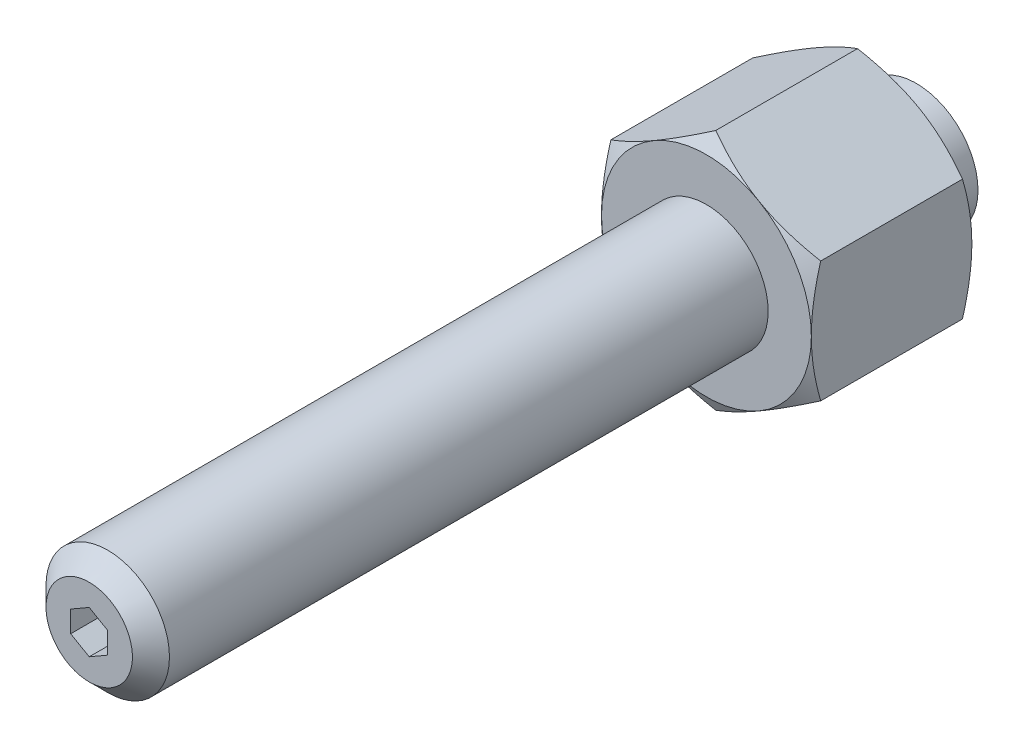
ISO-10303-21;
HEADER;
FILE_DESCRIPTION(('STEP AP214'),'2;1');
FILE_NAME('part.step','',(''),(''),'','','');
FILE_SCHEMA(('AUTOMOTIVE_DESIGN { 1 0 10303 214 1 1 1 1 }'));
ENDSEC;
DATA;
#1=APPLICATION_CONTEXT('core data for automotive mechanical design processes');
#2=APPLICATION_PROTOCOL_DEFINITION('international standard','automotive_design',2000,#1);
#3=PRODUCT_CONTEXT('',#1,'mechanical');
#4=PRODUCT('Part','Part','',(#3));
#5=PRODUCT_RELATED_PRODUCT_CATEGORY('part','',(#4));
#6=PRODUCT_DEFINITION_FORMATION('','',#4);
#7=PRODUCT_DEFINITION_CONTEXT('part definition',#1,'design');
#8=PRODUCT_DEFINITION('design','',#6,#7);
#9=PRODUCT_DEFINITION_SHAPE('','',#8);
#10=(LENGTH_UNIT() NAMED_UNIT(*) SI_UNIT(.MILLI.,.METRE.));
#11=(NAMED_UNIT(*) PLANE_ANGLE_UNIT() SI_UNIT($,.RADIAN.));
#12=(NAMED_UNIT(*) SI_UNIT($,.STERADIAN.) SOLID_ANGLE_UNIT());
#13=UNCERTAINTY_MEASURE_WITH_UNIT(LENGTH_MEASURE(1.E-05),#10,'distance_accuracy_value','');
#14=(GEOMETRIC_REPRESENTATION_CONTEXT(3) GLOBAL_UNCERTAINTY_ASSIGNED_CONTEXT((#13)) GLOBAL_UNIT_ASSIGNED_CONTEXT((#10,
#11,#12)) REPRESENTATION_CONTEXT('',''));
#15=CARTESIAN_POINT('',(0.,0.,0.));
#16=DIRECTION('',(0.,0.,1.));
#17=DIRECTION('',(1.,0.,0.));
#18=AXIS2_PLACEMENT_3D('',#15,#16,#17);
#19=CARTESIAN_POINT('',(0.,-9.81495457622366,47.));
#20=DIRECTION('',(-0.5,-0.866025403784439,0.));
#21=DIRECTION('',(-0.866025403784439,0.5,0.));
#22=AXIS2_PLACEMENT_3D('',#19,#20,#21);
#23=PLANE('',#22);
#24=DIRECTION('',(0.,0.,-1.));
#25=VECTOR('',#24,1.);
#26=CARTESIAN_POINT('',(-8.5,-4.90747728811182,47.));
#27=LINE('',#26,#25);
#28=CARTESIAN_POINT('',(-8.5,-4.90747728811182,16.2408106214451));
#29=VERTEX_POINT('',#28);
#30=CARTESIAN_POINT('',(-8.5,-4.90747728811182,4.75918937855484));
#31=VERTEX_POINT('',#30);
#32=EDGE_CURVE('E170',#29,#31,#27,.T.);
#33=ORIENTED_EDGE('',*,*,#32,.T.);
#34=CARTESIAN_POINT('',(-8.5002,-4.90736181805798,4.75925604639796));
#35=CARTESIAN_POINT('',(-8.31336077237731,-5.01523349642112,4.69698613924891));
#36=CARTESIAN_POINT('',(-8.1258249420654,-5.1235073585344,4.63754229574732));
#37=CARTESIAN_POINT('',(-7.74923024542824,-5.34093440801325,4.52508511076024));
#38=CARTESIAN_POINT('',(-7.56017075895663,-5.45008795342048,4.47207454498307));
#39=CARTESIAN_POINT('',(-6.9899652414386,-5.77929626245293,4.32373338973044));
#40=CARTESIAN_POINT('',(-6.60656835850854,-6.00065055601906,4.23935892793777));
#41=CARTESIAN_POINT('',(-6.03282233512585,-6.33190297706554,4.14042001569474));
#42=CARTESIAN_POINT('',(-5.84418723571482,-6.44081150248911,4.11223519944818));
#43=CARTESIAN_POINT('',(-5.4660639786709,-6.65912106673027,4.06497408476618));
#44=CARTESIAN_POINT('',(-5.27657589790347,-6.76852206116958,4.04589698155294));
#45=CARTESIAN_POINT('',(-4.89727347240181,-6.98751241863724,4.01733477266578));
#46=CARTESIAN_POINT('',(-4.70745974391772,-7.09710142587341,4.00783878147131));
#47=CARTESIAN_POINT('',(-4.32765694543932,-7.31638067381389,3.99864237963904));
#48=CARTESIAN_POINT('',(-4.13766788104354,-7.42607091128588,3.99894166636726));
#49=CARTESIAN_POINT('',(-3.78247698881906,-7.63114046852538,4.0086544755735));
#50=CARTESIAN_POINT('',(-3.6172500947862,-7.72653426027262,4.01688316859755));
#51=CARTESIAN_POINT('',(-3.28718328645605,-7.91709842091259,4.04058924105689));
#52=CARTESIAN_POINT('',(-3.12234339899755,-8.01226877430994,4.05606710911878));
#53=CARTESIAN_POINT('',(-2.62846189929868,-8.29741139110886,4.11300862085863));
#54=CARTESIAN_POINT('',(-2.30029449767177,-8.48687892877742,4.16497306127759));
#55=CARTESIAN_POINT('',(-1.64047857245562,-8.86782383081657,4.29488494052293));
#56=CARTESIAN_POINT('',(-1.30891425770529,-9.05925257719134,4.37338306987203));
#57=CARTESIAN_POINT('',(-0.650730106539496,-9.43925537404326,4.55154133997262));
#58=CARTESIAN_POINT('',(-0.324101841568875,-9.62783429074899,4.65115963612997));
#59=CARTESIAN_POINT('',(0.000200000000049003,-9.8150700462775,4.75925604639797));
#60=B_SPLINE_CURVE_WITH_KNOTS('',3,(#34,#35,#36,#37,#38,#39,#40,#41,#42,#43,#44,#45,#46,#47,#48,
#49,#50,#51,#52,#53,#54,#55,#56,#57,#58,#59),.UNSPECIFIED.,.F.,.F.,(4,2,2,2,2,2,2,2,2,2,2,2,4),
(0.,0.673596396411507,1.34748239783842,2.69805431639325,3.35679995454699,4.01548737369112,
4.67342558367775,5.33134346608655,5.90409556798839,6.47688628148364,7.62328361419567,
8.7951056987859,9.96462743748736),.UNSPECIFIED.);
#61=CARTESIAN_POINT('',(-4.25,-7.36121593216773,4.));
#62=VERTEX_POINT('',#61);
#63=EDGE_CURVE('E149',#31,#62,#60,.T.);
#64=ORIENTED_EDGE('',*,*,#63,.T.);
#65=CARTESIAN_POINT('',(0.,-9.81495457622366,4.75918937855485));
#66=VERTEX_POINT('',#65);
#67=EDGE_CURVE('E160',#62,#66,#60,.T.);
#68=ORIENTED_EDGE('',*,*,#67,.T.);
#69=DIRECTION('',(0.,0.,-1.));
#70=VECTOR('',#69,1.);
#71=CARTESIAN_POINT('',(0.,-9.81495457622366,47.));
#72=LINE('',#71,#70);
#73=CARTESIAN_POINT('',(0.,-9.81495457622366,16.2408106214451));
#74=VERTEX_POINT('',#73);
#75=EDGE_CURVE('E349',#74,#66,#72,.T.);
#76=ORIENTED_EDGE('',*,*,#75,.F.);
#77=CARTESIAN_POINT('',(0.000200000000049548,-9.8150700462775,16.240743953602));
#78=CARTESIAN_POINT('',(-0.186639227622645,-9.70719836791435,16.3030138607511));
#79=CARTESIAN_POINT('',(-0.374175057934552,-9.59892450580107,16.3624577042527));
#80=CARTESIAN_POINT('',(-0.750769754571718,-9.38149745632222,16.4749148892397));
#81=CARTESIAN_POINT('',(-0.939829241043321,-9.27234391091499,16.5279254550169));
#82=CARTESIAN_POINT('',(-1.51003475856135,-8.94313560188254,16.6762666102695));
#83=CARTESIAN_POINT('',(-1.89343164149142,-8.72178130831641,16.7606410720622));
#84=CARTESIAN_POINT('',(-2.46717766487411,-8.39052888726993,16.8595799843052));
#85=CARTESIAN_POINT('',(-2.65581276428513,-8.28162036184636,16.8877648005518));
#86=CARTESIAN_POINT('',(-3.03393602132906,-8.0633107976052,16.9350259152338));
#87=CARTESIAN_POINT('',(-3.22342410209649,-7.95390980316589,16.954103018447));
#88=CARTESIAN_POINT('',(-3.60272652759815,-7.73491944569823,16.9826652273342));
#89=CARTESIAN_POINT('',(-3.79254025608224,-7.62533043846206,16.9921612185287));
#90=CARTESIAN_POINT('',(-4.17234305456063,-7.40605119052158,17.0013576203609));
#91=CARTESIAN_POINT('',(-4.36233211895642,-7.29636095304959,17.0010583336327));
#92=CARTESIAN_POINT('',(-4.7175230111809,-7.09129139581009,16.9913455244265));
#93=CARTESIAN_POINT('',(-4.88274990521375,-6.99589760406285,16.9831168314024));
#94=CARTESIAN_POINT('',(-5.21281671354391,-6.80533344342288,16.9594107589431));
#95=CARTESIAN_POINT('',(-5.3776566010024,-6.71016309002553,16.9439328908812));
#96=CARTESIAN_POINT('',(-5.87153810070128,-6.42502047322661,16.8869913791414));
#97=CARTESIAN_POINT('',(-6.19970550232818,-6.23555293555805,16.8350269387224));
#98=CARTESIAN_POINT('',(-6.85952142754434,-5.8546080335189,16.7051150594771));
#99=CARTESIAN_POINT('',(-7.19108574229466,-5.66317928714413,16.626616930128));
#100=CARTESIAN_POINT('',(-7.84926989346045,-5.28317649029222,16.4484586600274));
#101=CARTESIAN_POINT('',(-8.17589815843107,-5.09459757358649,16.34884036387));
#102=CARTESIAN_POINT('',(-8.5002,-4.90736181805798,16.240743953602));
#103=B_SPLINE_CURVE_WITH_KNOTS('',3,(#77,#78,#79,#80,#81,#82,#83,#84,#85,#86,#87,#88,#89,#90,
#91,#92,#93,#94,#95,#96,#97,#98,#99,#100,#101,#102),.UNSPECIFIED.,.F.,.F.,(4,2,2,2,2,2,2,2,2,2,
2,2,4),(0.,0.673596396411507,1.34748239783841,2.69805431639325,3.35679995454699,
4.01548737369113,4.67342558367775,5.33134346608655,5.9040955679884,6.47688628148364,
7.62328361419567,8.79510569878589,9.96462743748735),.UNSPECIFIED.);
#104=CARTESIAN_POINT('',(-4.25,-7.36121593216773,17.));
#105=VERTEX_POINT('',#104);
#106=EDGE_CURVE('E347',#74,#105,#103,.T.);
#107=ORIENTED_EDGE('',*,*,#106,.T.);
#108=EDGE_CURVE('E235',#105,#29,#103,.T.);
#109=ORIENTED_EDGE('',*,*,#108,.T.);
#110=EDGE_LOOP('',(#33,#64,#68,#76,#107,#109));
#111=FACE_BOUND('',#110,.T.);
#112=ADVANCED_FACE('F14',(#111),#23,.T.);
#113=CARTESIAN_POINT('',(-8.5,-4.90747728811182,47.));
#114=DIRECTION('',(-1.,0.,0.));
#115=DIRECTION('',(0.,1.,0.));
#116=AXIS2_PLACEMENT_3D('',#113,#114,#115);
#117=PLANE('',#116);
#118=DIRECTION('',(0.,0.,-1.));
#119=VECTOR('',#118,1.);
#120=CARTESIAN_POINT('',(-8.5,4.90747728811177,47.));
#121=LINE('',#120,#119);
#122=CARTESIAN_POINT('',(-8.5,4.90747728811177,16.2408106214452));
#123=VERTEX_POINT('',#122);
#124=CARTESIAN_POINT('',(-8.5,4.90747728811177,4.75918937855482));
#125=VERTEX_POINT('',#124);
#126=EDGE_CURVE('E306',#123,#125,#121,.T.);
#127=ORIENTED_EDGE('',*,*,#126,.T.);
#128=CARTESIAN_POINT('',(-8.5,-13.1405770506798,8.12809620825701));
#129=CARTESIAN_POINT('',(-8.5,-12.7696785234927,7.94834446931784));
#130=CARTESIAN_POINT('',(-8.5,-12.3979241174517,7.77032829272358));
#131=CARTESIAN_POINT('',(-8.5,-11.6522482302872,7.41874400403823));
#132=CARTESIAN_POINT('',(-8.5,-11.2783264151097,7.24517660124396));
#133=CARTESIAN_POINT('',(-8.5,-10.5259137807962,6.90258465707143));
#134=CARTESIAN_POINT('',(-8.5,-10.1474091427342,6.73359035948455));
#135=CARTESIAN_POINT('',(-8.5,-9.38737493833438,6.40257307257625));
#136=CARTESIAN_POINT('',(-8.5,-9.0058455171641,6.24054975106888));
#137=CARTESIAN_POINT('',(-8.5,-8.22698756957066,5.92031360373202));
#138=CARTESIAN_POINT('',(-8.5,-7.82954170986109,5.76238455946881));
#139=CARTESIAN_POINT('',(-8.5,-7.02998575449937,5.45857991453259));
#140=CARTESIAN_POINT('',(-8.5,-6.62787513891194,5.31270567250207));
#141=CARTESIAN_POINT('',(-8.5,-5.81911128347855,5.03687112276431));
#142=CARTESIAN_POINT('',(-8.5,-5.41246927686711,4.90687823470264));
#143=CARTESIAN_POINT('',(-8.5,-4.59336714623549,4.66700327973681));
#144=CARTESIAN_POINT('',(-8.5,-4.18090891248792,4.55711483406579));
#145=CARTESIAN_POINT('',(-8.5,-3.35215975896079,4.36334108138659));
#146=CARTESIAN_POINT('',(-8.5,-2.93590245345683,4.27931591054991));
#147=CARTESIAN_POINT('',(-8.5,-2.30775927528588,4.17633241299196));
#148=CARTESIAN_POINT('',(-8.5,-2.09773623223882,4.14584554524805));
#149=CARTESIAN_POINT('',(-8.5,-1.67666040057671,4.09315548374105));
#150=CARTESIAN_POINT('',(-8.5,-1.46560771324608,4.07095149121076));
#151=CARTESIAN_POINT('',(-8.5,-1.04549378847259,4.03554583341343));
#152=CARTESIAN_POINT('',(-8.5,-0.836442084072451,4.02223148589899));
#153=CARTESIAN_POINT('',(-8.5,-0.417963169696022,4.00445222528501));
#154=CARTESIAN_POINT('',(-8.5,-0.208535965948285,3.99998716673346));
#155=CARTESIAN_POINT('',(-8.5,0.210319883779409,4.00001288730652));
#156=CARTESIAN_POINT('',(-8.5,0.419748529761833,4.00450369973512));
#157=CARTESIAN_POINT('',(-8.5,0.838231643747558,4.02233211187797));
#158=CARTESIAN_POINT('',(-8.5,1.04728609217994,4.03567016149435));
#159=CARTESIAN_POINT('',(-8.5,1.55098560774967,4.07818485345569));
#160=CARTESIAN_POINT('',(-8.5,1.84527784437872,4.11163018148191));
#161=CARTESIAN_POINT('',(-8.5,2.43163675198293,4.19421887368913));
#162=CARTESIAN_POINT('',(-8.5,2.72370310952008,4.24336440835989));
#163=CARTESIAN_POINT('',(-8.5,3.59625361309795,4.41174179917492));
#164=CARTESIAN_POINT('',(-8.5,4.17275403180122,4.55188244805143));
#165=CARTESIAN_POINT('',(-8.5,5.03469433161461,4.79437346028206));
#166=CARTESIAN_POINT('',(-8.5,5.32461868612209,4.88169605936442));
#167=CARTESIAN_POINT('',(-8.5,5.90165069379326,5.065281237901));
#168=CARTESIAN_POINT('',(-8.5,6.1887583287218,5.16154387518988));
#169=CARTESIAN_POINT('',(-8.5,6.76024945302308,5.36147548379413));
#170=CARTESIAN_POINT('',(-8.5,7.04463383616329,5.46514192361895));
#171=CARTESIAN_POINT('',(-8.5,7.6110554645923,5.6786743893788));
#172=CARTESIAN_POINT('',(-8.5,7.89309273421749,5.78854035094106));
#173=CARTESIAN_POINT('',(-8.5,8.54541738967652,6.04959181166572));
#174=CARTESIAN_POINT('',(-8.5,8.91493085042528,6.20270733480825));
#175=CARTESIAN_POINT('',(-8.5,9.65091703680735,6.51610002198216));
#176=CARTESIAN_POINT('',(-8.5,10.0173895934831,6.67637758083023));
#177=CARTESIAN_POINT('',(-8.5,10.7478422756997,7.00269738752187));
#178=CARTESIAN_POINT('',(-8.5,11.1118218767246,7.16874080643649));
#179=CARTESIAN_POINT('',(-8.5,11.837618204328,7.50546065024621));
#180=CARTESIAN_POINT('',(-8.5,12.1994349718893,7.67613698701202));
#181=CARTESIAN_POINT('',(-8.5,12.9216241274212,8.02145260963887));
#182=CARTESIAN_POINT('',(-8.5,13.2819946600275,8.1960957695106));
#183=CARTESIAN_POINT('',(-8.5,14.0012004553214,8.54851803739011));
#184=CARTESIAN_POINT('',(-8.5,14.3600357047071,8.72629717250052));
#185=CARTESIAN_POINT('',(-8.5,15.4345085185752,9.26347991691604));
#186=CARTESIAN_POINT('',(-8.5,16.1482020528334,9.62677171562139));
#187=CARTESIAN_POINT('',(-8.5,17.5142362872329,10.3310318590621));
#188=CARTESIAN_POINT('',(-8.5,18.1668721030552,10.6714302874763));
#189=CARTESIAN_POINT('',(-8.5,19.4696939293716,11.3569307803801));
#190=CARTESIAN_POINT('',(-8.50000000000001,20.1198798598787,11.7020329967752));
#191=CARTESIAN_POINT('',(-8.50000000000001,21.4167976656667,12.3950146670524));
#192=CARTESIAN_POINT('',(-8.50000000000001,22.0635340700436,12.7428856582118));
#193=CARTESIAN_POINT('',(-8.50000000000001,23.355432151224,13.4414603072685));
#194=CARTESIAN_POINT('',(-8.5,24.0005939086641,13.7921638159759));
#195=CARTESIAN_POINT('',(-8.5,24.645172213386,14.1439292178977));
#196=B_SPLINE_CURVE_WITH_KNOTS('',3,(#128,#129,#130,#131,#132,#133,#134,#135,#136,#137,#138,
#139,#140,#141,#142,#143,#144,#145,#146,#147,#148,#149,#150,#151,#152,#153,#154,#155,#156,#157,
#158,#159,#160,#161,#162,#163,#164,#165,#166,#167,#168,#169,#170,#171,#172,#173,#174,#175,#176,
#177,#178,#179,#180,#181,#182,#183,#184,#185,#186,#187,#188,#189,#190,#191,#192,#193,#194,#195),
.UNSPECIFIED.,.F.,.F.,(4,2,2,2,2,2,2,2,2,2,2,2,2,2,2,2,2,2,2,2,2,2,2,2,2,2,2,2,2,2,2,2,2,4),(0.,
1.23649726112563,2.47319045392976,3.71668692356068,4.96012407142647,6.24299347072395,
7.52600725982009,8.80634311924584,10.0862720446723,11.3591525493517,11.9956876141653,
12.6321612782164,13.2604057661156,13.8886399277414,14.5168764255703,15.1451448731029,
16.0332019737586,16.9213818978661,18.6987472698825,19.6070411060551,20.5153408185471,
21.4233314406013,22.3313126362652,23.5311544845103,24.7310625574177,25.9312157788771,
27.1313461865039,28.3327038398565,29.5340718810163,31.9365119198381,34.1447127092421,
36.3529849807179,38.556052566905,40.7590048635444),.UNSPECIFIED.);
#197=CARTESIAN_POINT('',(-8.5,0.,4.));
#198=VERTEX_POINT('',#197);
#199=EDGE_CURVE('E289',#125,#198,#196,.F.);
#200=ORIENTED_EDGE('',*,*,#199,.T.);
#201=EDGE_CURVE('E151',#198,#31,#196,.F.);
#202=ORIENTED_EDGE('',*,*,#201,.T.);
#203=ORIENTED_EDGE('',*,*,#32,.F.);
#204=CARTESIAN_POINT('',(-8.5,-13.1405770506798,12.871903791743));
#205=CARTESIAN_POINT('',(-8.5,-12.7696785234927,13.0516555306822));
#206=CARTESIAN_POINT('',(-8.5,-12.3979241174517,13.2296717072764));
#207=CARTESIAN_POINT('',(-8.5,-11.6522482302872,13.5812559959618));
#208=CARTESIAN_POINT('',(-8.5,-11.2783264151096,13.754823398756));
#209=CARTESIAN_POINT('',(-8.5,-10.5259137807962,14.0974153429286));
#210=CARTESIAN_POINT('',(-8.5,-10.1474091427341,14.2664096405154));
#211=CARTESIAN_POINT('',(-8.5,-9.38737493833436,14.5974269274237));
#212=CARTESIAN_POINT('',(-8.5,-9.00584551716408,14.7594502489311));
#213=CARTESIAN_POINT('',(-8.5,-8.22698756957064,15.079686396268));
#214=CARTESIAN_POINT('',(-8.5,-7.82954170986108,15.2376154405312));
#215=CARTESIAN_POINT('',(-8.5,-7.02998575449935,15.5414200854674));
#216=CARTESIAN_POINT('',(-8.5,-6.62787513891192,15.6872943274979));
#217=CARTESIAN_POINT('',(-8.5,-5.81911128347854,15.9631288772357));
#218=CARTESIAN_POINT('',(-8.5,-5.41246927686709,16.0931217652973));
#219=CARTESIAN_POINT('',(-8.5,-4.59336714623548,16.3329967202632));
#220=CARTESIAN_POINT('',(-8.5,-4.18090891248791,16.4428851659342));
#221=CARTESIAN_POINT('',(-8.5,-3.35215975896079,16.6366589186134));
#222=CARTESIAN_POINT('',(-8.5,-2.93590245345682,16.7206840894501));
#223=CARTESIAN_POINT('',(-8.5,-2.30775927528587,16.823667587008));
#224=CARTESIAN_POINT('',(-8.5,-2.09773623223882,16.8541544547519));
#225=CARTESIAN_POINT('',(-8.5,-1.67666040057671,16.9068445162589));
#226=CARTESIAN_POINT('',(-8.5,-1.46560771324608,16.9290485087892));
#227=CARTESIAN_POINT('',(-8.5,-1.04549378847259,16.9644541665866));
#228=CARTESIAN_POINT('',(-8.5,-0.836442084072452,16.977768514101));
#229=CARTESIAN_POINT('',(-8.5,-0.417963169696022,16.995547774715));
#230=CARTESIAN_POINT('',(-8.5,-0.208535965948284,17.0000128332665));
#231=CARTESIAN_POINT('',(-8.5,0.210319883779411,16.9999871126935));
#232=CARTESIAN_POINT('',(-8.5,0.419748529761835,16.9954963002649));
#233=CARTESIAN_POINT('',(-8.5,0.838231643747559,16.977667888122));
#234=CARTESIAN_POINT('',(-8.5,1.04728609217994,16.9643298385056));
#235=CARTESIAN_POINT('',(-8.5,1.55098560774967,16.9218151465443));
#236=CARTESIAN_POINT('',(-8.5,1.84527784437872,16.8883698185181));
#237=CARTESIAN_POINT('',(-8.5,2.43163675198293,16.8057811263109));
#238=CARTESIAN_POINT('',(-8.5,2.72370310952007,16.7566355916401));
#239=CARTESIAN_POINT('',(-8.5,3.59625361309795,16.5882582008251));
#240=CARTESIAN_POINT('',(-8.5,4.17275403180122,16.4481175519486));
#241=CARTESIAN_POINT('',(-8.5,5.03469433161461,16.2056265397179));
#242=CARTESIAN_POINT('',(-8.5,5.32461868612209,16.1183039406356));
#243=CARTESIAN_POINT('',(-8.5,5.90165069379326,15.934718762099));
#244=CARTESIAN_POINT('',(-8.5,6.1887583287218,15.8384561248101));
#245=CARTESIAN_POINT('',(-8.5,6.76024945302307,15.6385245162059));
#246=CARTESIAN_POINT('',(-8.5,7.04463383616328,15.534858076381));
#247=CARTESIAN_POINT('',(-8.5,7.6110554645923,15.3213256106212));
#248=CARTESIAN_POINT('',(-8.5,7.89309273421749,15.211459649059));
#249=CARTESIAN_POINT('',(-8.5,8.54541738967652,14.9504081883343));
#250=CARTESIAN_POINT('',(-8.5,8.91493085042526,14.7972926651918));
#251=CARTESIAN_POINT('',(-8.5,9.65091703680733,14.4838999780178));
#252=CARTESIAN_POINT('',(-8.5,10.0173895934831,14.3236224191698));
#253=CARTESIAN_POINT('',(-8.5,10.7478422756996,13.9973026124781));
#254=CARTESIAN_POINT('',(-8.5,11.1118218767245,13.8312591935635));
#255=CARTESIAN_POINT('',(-8.5,11.8376182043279,13.4945393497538));
#256=CARTESIAN_POINT('',(-8.5,12.1994349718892,13.323863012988));
#257=CARTESIAN_POINT('',(-8.5,12.9216241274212,12.9785473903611));
#258=CARTESIAN_POINT('',(-8.5,13.2819946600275,12.8039042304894));
#259=CARTESIAN_POINT('',(-8.5,14.0012004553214,12.4514819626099));
#260=CARTESIAN_POINT('',(-8.5,14.360035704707,12.2737028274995));
#261=CARTESIAN_POINT('',(-8.5,15.4345085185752,11.736520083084));
#262=CARTESIAN_POINT('',(-8.5,16.1482020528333,11.3732282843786));
#263=CARTESIAN_POINT('',(-8.5,17.5142362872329,10.6689681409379));
#264=CARTESIAN_POINT('',(-8.5,18.1668721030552,10.3285697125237));
#265=CARTESIAN_POINT('',(-8.5,19.4696939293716,9.64306921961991));
#266=CARTESIAN_POINT('',(-8.50000000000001,20.1198798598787,9.29796700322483));
#267=CARTESIAN_POINT('',(-8.50000000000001,21.4167976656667,8.60498533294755));
#268=CARTESIAN_POINT('',(-8.50000000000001,22.0635340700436,8.25711434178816));
#269=CARTESIAN_POINT('',(-8.50000000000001,23.355432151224,7.55853969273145));
#270=CARTESIAN_POINT('',(-8.5,24.0005939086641,7.20783618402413));
#271=CARTESIAN_POINT('',(-8.5,24.645172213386,6.85607078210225));
#272=B_SPLINE_CURVE_WITH_KNOTS('',3,(#204,#205,#206,#207,#208,#209,#210,#211,#212,#213,#214,
#215,#216,#217,#218,#219,#220,#221,#222,#223,#224,#225,#226,#227,#228,#229,#230,#231,#232,#233,
#234,#235,#236,#237,#238,#239,#240,#241,#242,#243,#244,#245,#246,#247,#248,#249,#250,#251,#252,
#253,#254,#255,#256,#257,#258,#259,#260,#261,#262,#263,#264,#265,#266,#267,#268,#269,#270,#271),
.UNSPECIFIED.,.F.,.F.,(4,2,2,2,2,2,2,2,2,2,2,2,2,2,2,2,2,2,2,2,2,2,2,2,2,2,2,2,2,2,2,2,2,4),(0.,
1.23649726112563,2.47319045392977,3.71668692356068,4.96012407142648,6.24299347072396,
7.52600725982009,8.80634311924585,10.0862720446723,11.3591525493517,11.9956876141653,
12.6321612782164,13.2604057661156,13.8886399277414,14.5168764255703,15.1451448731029,
16.0332019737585,16.9213818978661,18.6987472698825,19.6070411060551,20.5153408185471,
21.4233314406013,22.3313126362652,23.5311544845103,24.7310625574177,25.9312157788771,
27.1313461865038,28.3327038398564,29.5340718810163,31.9365119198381,34.144712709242,
36.3529849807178,38.556052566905,40.7590048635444),.UNSPECIFIED.);
#273=CARTESIAN_POINT('',(-8.5,0.,17.));
#274=VERTEX_POINT('',#273);
#275=EDGE_CURVE('E245',#29,#274,#272,.T.);
#276=ORIENTED_EDGE('',*,*,#275,.T.);
#277=EDGE_CURVE('E265',#274,#123,#272,.T.);
#278=ORIENTED_EDGE('',*,*,#277,.T.);
#279=EDGE_LOOP('',(#127,#200,#202,#203,#276,#278));
#280=FACE_BOUND('',#279,.T.);
#281=ADVANCED_FACE('F269',(#280),#117,.T.);
#282=CARTESIAN_POINT('',(0.,9.81495457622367,47.));
#283=DIRECTION('',(0.500000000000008,-0.866025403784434,0.));
#284=DIRECTION('',(-0.866025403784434,-0.500000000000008,0.));
#285=AXIS2_PLACEMENT_3D('',#282,#283,#284);
#286=PLANE('',#285);
#287=CARTESIAN_POINT('',(-8.5002,4.90736181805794,4.75925604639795));
#288=CARTESIAN_POINT('',(-8.31336077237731,5.01523349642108,4.6969861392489));
#289=CARTESIAN_POINT('',(-8.1258249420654,5.12350735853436,4.63754229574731));
#290=CARTESIAN_POINT('',(-7.74923024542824,5.34093440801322,4.52508511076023));
#291=CARTESIAN_POINT('',(-7.56017075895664,5.45008795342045,4.47207454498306));
#292=CARTESIAN_POINT('',(-6.98996524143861,5.7792962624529,4.32373338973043));
#293=CARTESIAN_POINT('',(-6.60656835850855,6.00065055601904,4.23935892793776));
#294=CARTESIAN_POINT('',(-6.03282233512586,6.33190297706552,4.14042001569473));
#295=CARTESIAN_POINT('',(-5.84418723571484,6.44081150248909,4.11223519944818));
#296=CARTESIAN_POINT('',(-5.46606397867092,6.65912106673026,4.06497408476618));
#297=CARTESIAN_POINT('',(-5.27657589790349,6.76852206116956,4.04589698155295));
#298=CARTESIAN_POINT('',(-4.89727347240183,6.98751241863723,4.01733477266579));
#299=CARTESIAN_POINT('',(-4.70745974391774,7.09710142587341,4.00783878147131));
#300=CARTESIAN_POINT('',(-4.32765694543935,7.31638067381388,3.99864237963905));
#301=CARTESIAN_POINT('',(-4.13766788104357,7.42607091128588,3.99894166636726));
#302=CARTESIAN_POINT('',(-3.78247698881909,7.63114046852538,4.00865447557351));
#303=CARTESIAN_POINT('',(-3.61725009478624,7.72653426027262,4.01688316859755));
#304=CARTESIAN_POINT('',(-3.28718328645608,7.9170984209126,4.0405892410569));
#305=CARTESIAN_POINT('',(-3.1223433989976,8.01226877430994,4.05606710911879));
#306=CARTESIAN_POINT('',(-2.62846189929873,8.29741139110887,4.11300862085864));
#307=CARTESIAN_POINT('',(-2.30029449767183,8.48687892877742,4.16497306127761));
#308=CARTESIAN_POINT('',(-1.64047857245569,8.86782383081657,4.29488494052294));
#309=CARTESIAN_POINT('',(-1.30891425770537,9.05925257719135,4.37338306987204));
#310=CARTESIAN_POINT('',(-0.650730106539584,9.43925537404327,4.55154133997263));
#311=CARTESIAN_POINT('',(-0.324101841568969,9.627834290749,4.65115963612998));
#312=CARTESIAN_POINT('',(0.000199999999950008,9.81507004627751,4.75925604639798));
#313=B_SPLINE_CURVE_WITH_KNOTS('',3,(#287,#288,#289,#290,#291,#292,#293,#294,#295,#296,#297,
#298,#299,#300,#301,#302,#303,#304,#305,#306,#307,#308,#309,#310,#311,#312),.UNSPECIFIED.,.F.,
.F.,(4,2,2,2,2,2,2,2,2,2,2,2,4),(0.,0.673596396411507,1.34748239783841,2.69805431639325,
3.35679995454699,4.01548737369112,4.67342558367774,5.33134346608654,5.90409556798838,
6.47688628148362,7.62328361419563,8.79510569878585,9.9646274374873),.UNSPECIFIED.);
#314=CARTESIAN_POINT('',(-4.25000000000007,7.3612159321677,4.));
#315=VERTEX_POINT('',#314);
#316=EDGE_CURVE('E280',#125,#315,#313,.T.);
#317=ORIENTED_EDGE('',*,*,#316,.F.);
#318=ORIENTED_EDGE('',*,*,#126,.F.);
#319=CARTESIAN_POINT('',(0.000199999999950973,9.81507004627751,16.240743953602));
#320=CARTESIAN_POINT('',(-0.186639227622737,9.70719836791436,16.3030138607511));
#321=CARTESIAN_POINT('',(-0.374175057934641,9.59892450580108,16.3624577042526));
#322=CARTESIAN_POINT('',(-0.750769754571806,9.38149745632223,16.4749148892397));
#323=CARTESIAN_POINT('',(-0.93982924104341,9.27234391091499,16.5279254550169));
#324=CARTESIAN_POINT('',(-1.51003475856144,8.94313560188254,16.6762666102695));
#325=CARTESIAN_POINT('',(-1.8934316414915,8.7217813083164,16.7606410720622));
#326=CARTESIAN_POINT('',(-2.4671776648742,8.39052888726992,16.8595799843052));
#327=CARTESIAN_POINT('',(-2.65581276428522,8.28162036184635,16.8877648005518));
#328=CARTESIAN_POINT('',(-3.03393602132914,8.06331079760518,16.9350259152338));
#329=CARTESIAN_POINT('',(-3.22342410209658,7.95390980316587,16.954103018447));
#330=CARTESIAN_POINT('',(-3.60272652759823,7.73491944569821,16.9826652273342));
#331=CARTESIAN_POINT('',(-3.79254025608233,7.62533043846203,16.9921612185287));
#332=CARTESIAN_POINT('',(-4.17234305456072,7.40605119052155,17.0013576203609));
#333=CARTESIAN_POINT('',(-4.3623321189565,7.29636095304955,17.0010583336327));
#334=CARTESIAN_POINT('',(-4.71752301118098,7.09129139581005,16.9913455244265));
#335=CARTESIAN_POINT('',(-4.88274990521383,6.99589760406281,16.9831168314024));
#336=CARTESIAN_POINT('',(-5.21281671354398,6.80533344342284,16.9594107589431));
#337=CARTESIAN_POINT('',(-5.37765660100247,6.71016309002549,16.9439328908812));
#338=CARTESIAN_POINT('',(-5.87153810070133,6.42502047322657,16.8869913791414));
#339=CARTESIAN_POINT('',(-6.19970550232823,6.23555293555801,16.8350269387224));
#340=CARTESIAN_POINT('',(-6.85952142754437,5.85460803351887,16.7051150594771));
#341=CARTESIAN_POINT('',(-7.19108574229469,5.66317928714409,16.626616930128));
#342=CARTESIAN_POINT('',(-7.84926989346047,5.28317649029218,16.4484586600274));
#343=CARTESIAN_POINT('',(-8.17589815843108,5.09459757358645,16.34884036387));
#344=CARTESIAN_POINT('',(-8.5002,4.90736181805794,16.240743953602));
#345=B_SPLINE_CURVE_WITH_KNOTS('',3,(#319,#320,#321,#322,#323,#324,#325,#326,#327,#328,#329,
#330,#331,#332,#333,#334,#335,#336,#337,#338,#339,#340,#341,#342,#343,#344),.UNSPECIFIED.,.F.,
.F.,(4,2,2,2,2,2,2,2,2,2,2,2,4),(0.,0.673596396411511,1.34748239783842,2.69805431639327,
3.35679995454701,4.01548737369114,4.67342558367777,5.33134346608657,5.90409556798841,
6.47688628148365,7.62328361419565,8.79510569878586,9.9646274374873),.UNSPECIFIED.);
#346=CARTESIAN_POINT('',(-4.25000000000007,7.3612159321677,17.));
#347=VERTEX_POINT('',#346);
#348=EDGE_CURVE('E259',#347,#123,#345,.T.);
#349=ORIENTED_EDGE('',*,*,#348,.F.);
#350=CARTESIAN_POINT('',(0.,9.81495457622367,16.2408106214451));
#351=VERTEX_POINT('',#350);
#352=EDGE_CURVE('E264',#351,#347,#345,.T.);
#353=ORIENTED_EDGE('',*,*,#352,.F.);
#354=DIRECTION('',(0.,0.,-1.));
#355=VECTOR('',#354,1.);
#356=CARTESIAN_POINT('',(0.,9.81495457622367,47.));
#357=LINE('',#356,#355);
#358=CARTESIAN_POINT('',(0.,9.81495457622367,4.75918937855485));
#359=VERTEX_POINT('',#358);
#360=EDGE_CURVE('E314',#351,#359,#357,.T.);
#361=ORIENTED_EDGE('',*,*,#360,.T.);
#362=EDGE_CURVE('E274',#315,#359,#313,.T.);
#363=ORIENTED_EDGE('',*,*,#362,.F.);
#364=EDGE_LOOP('',(#317,#318,#349,#353,#361,#363));
#365=FACE_BOUND('',#364,.T.);
#366=ADVANCED_FACE('F266',(#365),#286,.F.);
#367=CARTESIAN_POINT('',(0.,9.81495457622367,47.));
#368=DIRECTION('',(0.5,0.866025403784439,0.));
#369=DIRECTION('',(0.866025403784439,-0.5,0.));
#370=AXIS2_PLACEMENT_3D('',#367,#368,#369);
#371=PLANE('',#370);
#372=DIRECTION('',(0.,0.,-1.));
#373=VECTOR('',#372,1.);
#374=CARTESIAN_POINT('',(8.5,4.90747728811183,47.));
#375=LINE('',#374,#373);
#376=CARTESIAN_POINT('',(8.5,4.90747728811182,16.2408106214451));
#377=VERTEX_POINT('',#376);
#378=CARTESIAN_POINT('',(8.5,4.90747728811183,4.75918937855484));
#379=VERTEX_POINT('',#378);
#380=EDGE_CURVE('E326',#377,#379,#375,.T.);
#381=ORIENTED_EDGE('',*,*,#380,.T.);
#382=CARTESIAN_POINT('',(8.5002,4.90736181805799,4.75925604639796));
#383=CARTESIAN_POINT('',(8.31336077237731,5.01523349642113,4.69698613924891));
#384=CARTESIAN_POINT('',(8.1258249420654,5.12350735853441,4.63754229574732));
#385=CARTESIAN_POINT('',(7.74923024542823,5.34093440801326,4.52508511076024));
#386=CARTESIAN_POINT('',(7.56017075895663,5.45008795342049,4.47207454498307));
#387=CARTESIAN_POINT('',(6.9899652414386,5.77929626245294,4.32373338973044));
#388=CARTESIAN_POINT('',(6.60656835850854,6.00065055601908,4.23935892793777));
#389=CARTESIAN_POINT('',(6.03282233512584,6.33190297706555,4.14042001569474));
#390=CARTESIAN_POINT('',(5.84418723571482,6.44081150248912,4.11223519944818));
#391=CARTESIAN_POINT('',(5.46606397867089,6.65912106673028,4.06497408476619));
#392=CARTESIAN_POINT('',(5.27657589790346,6.76852206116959,4.04589698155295));
#393=CARTESIAN_POINT('',(4.8972734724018,6.98751241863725,4.01733477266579));
#394=CARTESIAN_POINT('',(4.70745974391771,7.09710142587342,4.00783878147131));
#395=CARTESIAN_POINT('',(4.32765694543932,7.3163806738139,3.99864237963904));
#396=CARTESIAN_POINT('',(4.13766788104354,7.42607091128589,3.99894166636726));
#397=CARTESIAN_POINT('',(3.78247698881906,7.63114046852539,4.00865447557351));
#398=CARTESIAN_POINT('',(3.6172500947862,7.72653426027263,4.01688316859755));
#399=CARTESIAN_POINT('',(3.28718328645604,7.91709842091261,4.04058924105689));
#400=CARTESIAN_POINT('',(3.12234339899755,8.01226877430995,4.05606710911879));
#401=CARTESIAN_POINT('',(2.62846189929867,8.29741139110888,4.11300862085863));
#402=CARTESIAN_POINT('',(2.30029449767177,8.48687892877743,4.1649730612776));
#403=CARTESIAN_POINT('',(1.64047857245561,8.86782383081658,4.29488494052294));
#404=CARTESIAN_POINT('',(1.30891425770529,9.05925257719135,4.37338306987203));
#405=CARTESIAN_POINT('',(0.650730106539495,9.43925537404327,4.55154133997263));
#406=CARTESIAN_POINT('',(0.324101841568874,9.627834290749,4.65115963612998));
#407=CARTESIAN_POINT('',(-0.000200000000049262,9.81507004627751,4.75925604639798));
#408=B_SPLINE_CURVE_WITH_KNOTS('',3,(#382,#383,#384,#385,#386,#387,#388,#389,#390,#391,#392,
#393,#394,#395,#396,#397,#398,#399,#400,#401,#402,#403,#404,#405,#406,#407),.UNSPECIFIED.,.F.,
.F.,(4,2,2,2,2,2,2,2,2,2,2,2,4),(0.,0.673596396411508,1.34748239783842,2.69805431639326,
3.35679995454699,4.01548737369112,4.67342558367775,5.33134346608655,5.9040955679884,
6.47688628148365,7.62328361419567,8.7951056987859,9.96462743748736),.UNSPECIFIED.);
#409=CARTESIAN_POINT('',(4.25,7.36121593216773,4.));
#410=VERTEX_POINT('',#409);
#411=EDGE_CURVE('E165',#379,#410,#408,.T.);
#412=ORIENTED_EDGE('',*,*,#411,.T.);
#413=EDGE_CURVE('E171',#410,#359,#408,.T.);
#414=ORIENTED_EDGE('',*,*,#413,.T.);
#415=ORIENTED_EDGE('',*,*,#360,.F.);
#416=CARTESIAN_POINT('',(-0.000200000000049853,9.81507004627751,16.240743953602));
#417=CARTESIAN_POINT('',(0.186639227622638,9.70719836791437,16.3030138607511));
#418=CARTESIAN_POINT('',(0.374175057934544,9.59892450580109,16.3624577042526));
#419=CARTESIAN_POINT('',(0.75076975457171,9.38149745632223,16.4749148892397));
#420=CARTESIAN_POINT('',(0.939829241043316,9.272343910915,16.5279254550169));
#421=CARTESIAN_POINT('',(1.51003475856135,8.94313560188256,16.6762666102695));
#422=CARTESIAN_POINT('',(1.89343164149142,8.72178130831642,16.7606410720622));
#423=CARTESIAN_POINT('',(2.46717766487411,8.39052888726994,16.8595799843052));
#424=CARTESIAN_POINT('',(2.65581276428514,8.28162036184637,16.8877648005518));
#425=CARTESIAN_POINT('',(3.03393602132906,8.0633107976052,16.9350259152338));
#426=CARTESIAN_POINT('',(3.2234241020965,7.9539098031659,16.954103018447));
#427=CARTESIAN_POINT('',(3.60272652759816,7.73491944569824,16.9826652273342));
#428=CARTESIAN_POINT('',(3.79254025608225,7.62533043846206,16.9921612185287));
#429=CARTESIAN_POINT('',(4.17234305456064,7.40605119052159,17.0013576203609));
#430=CARTESIAN_POINT('',(4.36233211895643,7.2963609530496,17.0010583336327));
#431=CARTESIAN_POINT('',(4.71752301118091,7.0912913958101,16.9913455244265));
#432=CARTESIAN_POINT('',(4.88274990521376,6.99589760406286,16.9831168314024));
#433=CARTESIAN_POINT('',(5.21281671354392,6.80533344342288,16.9594107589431));
#434=CARTESIAN_POINT('',(5.37765660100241,6.71016309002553,16.9439328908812));
#435=CARTESIAN_POINT('',(5.87153810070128,6.42502047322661,16.8869913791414));
#436=CARTESIAN_POINT('',(6.19970550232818,6.23555293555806,16.8350269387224));
#437=CARTESIAN_POINT('',(6.85952142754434,5.85460803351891,16.7051150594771));
#438=CARTESIAN_POINT('',(7.19108574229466,5.66317928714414,16.626616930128));
#439=CARTESIAN_POINT('',(7.84926989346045,5.28317649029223,16.4484586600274));
#440=CARTESIAN_POINT('',(8.17589815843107,5.0945975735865,16.34884036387));
#441=CARTESIAN_POINT('',(8.5002,4.90736181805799,16.240743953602));
#442=B_SPLINE_CURVE_WITH_KNOTS('',3,(#416,#417,#418,#419,#420,#421,#422,#423,#424,#425,#426,
#427,#428,#429,#430,#431,#432,#433,#434,#435,#436,#437,#438,#439,#440,#441),.UNSPECIFIED.,.F.,
.F.,(4,2,2,2,2,2,2,2,2,2,2,2,4),(0.,0.673596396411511,1.34748239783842,2.69805431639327,
3.35679995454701,4.01548737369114,4.67342558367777,5.33134346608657,5.90409556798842,
6.47688628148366,7.62328361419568,8.79510569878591,9.96462743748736),.UNSPECIFIED.);
#443=CARTESIAN_POINT('',(4.25,7.36121593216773,17.));
#444=VERTEX_POINT('',#443);
#445=EDGE_CURVE('E215',#351,#444,#442,.T.);
#446=ORIENTED_EDGE('',*,*,#445,.T.);
#447=EDGE_CURVE('E214',#444,#377,#442,.T.);
#448=ORIENTED_EDGE('',*,*,#447,.T.);
#449=EDGE_LOOP('',(#381,#412,#414,#415,#446,#448));
#450=FACE_BOUND('',#449,.T.);
#451=ADVANCED_FACE('F199',(#450),#371,.T.);
#452=CARTESIAN_POINT('',(8.5,-4.90747728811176,47.));
#453=DIRECTION('',(-1.,0.,0.));
#454=DIRECTION('',(0.,0.,-1.));
#455=AXIS2_PLACEMENT_3D('',#452,#453,#454);
#456=PLANE('',#455);
#457=CARTESIAN_POINT('',(8.5,-13.1405770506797,8.12809620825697));
#458=CARTESIAN_POINT('',(8.5,-12.7696785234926,7.9483444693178));
#459=CARTESIAN_POINT('',(8.5,-12.3979241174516,7.77032829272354));
#460=CARTESIAN_POINT('',(8.5,-11.6522482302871,7.4187440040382));
#461=CARTESIAN_POINT('',(8.5,-11.2783264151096,7.24517660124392));
#462=CARTESIAN_POINT('',(8.5,-10.5259137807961,6.9025846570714));
#463=CARTESIAN_POINT('',(8.5,-10.1474091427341,6.73359035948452));
#464=CARTESIAN_POINT('',(8.5,-9.3873749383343,6.40257307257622));
#465=CARTESIAN_POINT('',(8.5,-9.00584551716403,6.24054975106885));
#466=CARTESIAN_POINT('',(8.5,-8.22698756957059,5.920313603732));
#467=CARTESIAN_POINT('',(8.5,-7.82954170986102,5.76238455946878));
#468=CARTESIAN_POINT('',(8.5,-7.02998575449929,5.45857991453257));
#469=CARTESIAN_POINT('',(8.5,-6.62787513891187,5.31270567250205));
#470=CARTESIAN_POINT('',(8.5,-5.81911128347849,5.03687112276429));
#471=CARTESIAN_POINT('',(8.5,-5.41246927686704,4.90687823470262));
#472=CARTESIAN_POINT('',(8.5,-4.59336714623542,4.66700327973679));
#473=CARTESIAN_POINT('',(8.5,-4.18090891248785,4.55711483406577));
#474=CARTESIAN_POINT('',(8.5,-3.35215975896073,4.36334108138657));
#475=CARTESIAN_POINT('',(8.5,-2.93590245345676,4.27931591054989));
#476=CARTESIAN_POINT('',(8.5,-2.30775927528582,4.17633241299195));
#477=CARTESIAN_POINT('',(8.5,-2.09773623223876,4.14584554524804));
#478=CARTESIAN_POINT('',(8.5,-1.67666040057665,4.09315548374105));
#479=CARTESIAN_POINT('',(8.5,-1.46560771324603,4.07095149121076));
#480=CARTESIAN_POINT('',(8.5,-1.04549378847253,4.03554583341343));
#481=CARTESIAN_POINT('',(8.5,-0.836442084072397,4.02223148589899));
#482=CARTESIAN_POINT('',(8.5,-0.417963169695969,4.004452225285));
#483=CARTESIAN_POINT('',(8.5,-0.208535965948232,3.99998716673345));
#484=CARTESIAN_POINT('',(8.5,0.21031988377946,4.00001288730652));
#485=CARTESIAN_POINT('',(8.5,0.419748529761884,4.00450369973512));
#486=CARTESIAN_POINT('',(8.5,0.838231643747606,4.02233211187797));
#487=CARTESIAN_POINT('',(8.5,1.04728609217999,4.03567016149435));
#488=CARTESIAN_POINT('',(8.5,1.55098560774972,4.07818485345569));
#489=CARTESIAN_POINT('',(8.5,1.84527784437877,4.11163018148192));
#490=CARTESIAN_POINT('',(8.5,2.43163675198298,4.19421887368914));
#491=CARTESIAN_POINT('',(8.5,2.72370310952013,4.2433644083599));
#492=CARTESIAN_POINT('',(8.5,3.59625361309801,4.41174179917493));
#493=CARTESIAN_POINT('',(8.5,4.17275403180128,4.55188244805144));
#494=CARTESIAN_POINT('',(8.5,5.03469433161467,4.79437346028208));
#495=CARTESIAN_POINT('',(8.5,5.32461868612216,4.88169605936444));
#496=CARTESIAN_POINT('',(8.5,5.90165069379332,5.06528123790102));
#497=CARTESIAN_POINT('',(8.5,6.18875832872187,5.1615438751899));
#498=CARTESIAN_POINT('',(8.5,6.76024945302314,5.36147548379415));
#499=CARTESIAN_POINT('',(8.5,7.04463383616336,5.46514192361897));
#500=CARTESIAN_POINT('',(8.5,7.61105546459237,5.67867438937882));
#501=CARTESIAN_POINT('',(8.5,7.89309273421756,5.78854035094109));
#502=CARTESIAN_POINT('',(8.5,8.54541738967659,6.04959181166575));
#503=CARTESIAN_POINT('',(8.5,8.91493085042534,6.20270733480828));
#504=CARTESIAN_POINT('',(8.5,9.65091703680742,6.51610002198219));
#505=CARTESIAN_POINT('',(8.5,10.0173895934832,6.67637758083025));
#506=CARTESIAN_POINT('',(8.5,10.7478422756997,7.0026973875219));
#507=CARTESIAN_POINT('',(8.5,11.1118218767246,7.16874080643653));
#508=CARTESIAN_POINT('',(8.5,11.837618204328,7.50546065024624));
#509=CARTESIAN_POINT('',(8.5,12.1994349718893,7.67613698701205));
#510=CARTESIAN_POINT('',(8.5,12.9216241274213,8.0214526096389));
#511=CARTESIAN_POINT('',(8.5,13.2819946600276,8.19609576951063));
#512=CARTESIAN_POINT('',(8.5,14.0012004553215,8.54851803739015));
#513=CARTESIAN_POINT('',(8.5,14.3600357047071,8.72629717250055));
#514=CARTESIAN_POINT('',(8.5,15.4345085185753,9.26347991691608));
#515=CARTESIAN_POINT('',(8.5,16.1482020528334,9.62677171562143));
#516=CARTESIAN_POINT('',(8.5,17.514236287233,10.3310318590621));
#517=CARTESIAN_POINT('',(8.5,18.1668721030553,10.6714302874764));
#518=CARTESIAN_POINT('',(8.5,19.4696939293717,11.3569307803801));
#519=CARTESIAN_POINT('',(8.5,20.1198798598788,11.7020329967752));
#520=CARTESIAN_POINT('',(8.5,21.4167976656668,12.3950146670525));
#521=CARTESIAN_POINT('',(8.5,22.0635340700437,12.7428856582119));
#522=CARTESIAN_POINT('',(8.5,23.3554321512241,13.4414603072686));
#523=CARTESIAN_POINT('',(8.5,24.0005939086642,13.7921638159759));
#524=CARTESIAN_POINT('',(8.5,24.6451722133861,14.1439292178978));
#525=B_SPLINE_CURVE_WITH_KNOTS('',3,(#457,#458,#459,#460,#461,#462,#463,#464,#465,#466,#467,
#468,#469,#470,#471,#472,#473,#474,#475,#476,#477,#478,#479,#480,#481,#482,#483,#484,#485,#486,
#487,#488,#489,#490,#491,#492,#493,#494,#495,#496,#497,#498,#499,#500,#501,#502,#503,#504,#505,
#506,#507,#508,#509,#510,#511,#512,#513,#514,#515,#516,#517,#518,#519,#520,#521,#522,#523,#524),
.UNSPECIFIED.,.F.,.F.,(4,2,2,2,2,2,2,2,2,2,2,2,2,2,2,2,2,2,2,2,2,2,2,2,2,2,2,2,2,2,2,2,2,4),(0.,
1.23649726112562,2.47319045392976,3.71668692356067,4.96012407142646,6.24299347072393,
7.52600725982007,8.80634311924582,10.0862720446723,11.3591525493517,11.9956876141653,
12.6321612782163,13.2604057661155,13.8886399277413,14.5168764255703,15.1451448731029,
16.0332019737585,16.921381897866,18.6987472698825,19.607041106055,20.5153408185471,
21.4233314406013,22.3313126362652,23.5311544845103,24.7310625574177,25.9312157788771,
27.1313461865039,28.3327038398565,29.5340718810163,31.9365119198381,34.1447127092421,
36.3529849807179,38.556052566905,40.7590048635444),.UNSPECIFIED.);
#526=CARTESIAN_POINT('',(8.5,0.,4.));
#527=VERTEX_POINT('',#526);
#528=EDGE_CURVE('E185',#379,#527,#525,.F.);
#529=ORIENTED_EDGE('',*,*,#528,.F.);
#530=ORIENTED_EDGE('',*,*,#380,.F.);
#531=CARTESIAN_POINT('',(8.5,-13.1405770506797,12.871903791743));
#532=CARTESIAN_POINT('',(8.5,-12.7696785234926,13.0516555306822));
#533=CARTESIAN_POINT('',(8.5,-12.3979241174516,13.2296717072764));
#534=CARTESIAN_POINT('',(8.5,-11.6522482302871,13.5812559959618));
#535=CARTESIAN_POINT('',(8.5,-11.2783264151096,13.7548233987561));
#536=CARTESIAN_POINT('',(8.5,-10.5259137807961,14.0974153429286));
#537=CARTESIAN_POINT('',(8.5,-10.1474091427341,14.2664096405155));
#538=CARTESIAN_POINT('',(8.5,-9.3873749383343,14.5974269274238));
#539=CARTESIAN_POINT('',(8.5,-9.00584551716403,14.7594502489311));
#540=CARTESIAN_POINT('',(8.5,-8.22698756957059,15.079686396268));
#541=CARTESIAN_POINT('',(8.5,-7.82954170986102,15.2376154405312));
#542=CARTESIAN_POINT('',(8.5,-7.02998575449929,15.5414200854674));
#543=CARTESIAN_POINT('',(8.5,-6.62787513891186,15.6872943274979));
#544=CARTESIAN_POINT('',(8.5,-5.81911128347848,15.9631288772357));
#545=CARTESIAN_POINT('',(8.5,-5.41246927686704,16.0931217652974));
#546=CARTESIAN_POINT('',(8.5,-4.59336714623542,16.3329967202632));
#547=CARTESIAN_POINT('',(8.5,-4.18090891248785,16.4428851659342));
#548=CARTESIAN_POINT('',(8.5,-3.35215975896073,16.6366589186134));
#549=CARTESIAN_POINT('',(8.5,-2.93590245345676,16.7206840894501));
#550=CARTESIAN_POINT('',(8.5,-2.30775927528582,16.823667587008));
#551=CARTESIAN_POINT('',(8.5,-2.09773623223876,16.8541544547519));
#552=CARTESIAN_POINT('',(8.5,-1.67666040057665,16.9068445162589));
#553=CARTESIAN_POINT('',(8.5,-1.46560771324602,16.9290485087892));
#554=CARTESIAN_POINT('',(8.5,-1.04549378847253,16.9644541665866));
#555=CARTESIAN_POINT('',(8.5,-0.836442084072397,16.977768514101));
#556=CARTESIAN_POINT('',(8.5,-0.41796316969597,16.995547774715));
#557=CARTESIAN_POINT('',(8.5,-0.208535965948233,17.0000128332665));
#558=CARTESIAN_POINT('',(8.5,0.210319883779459,16.9999871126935));
#559=CARTESIAN_POINT('',(8.5,0.419748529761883,16.9954963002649));
#560=CARTESIAN_POINT('',(8.5,0.838231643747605,16.977667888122));
#561=CARTESIAN_POINT('',(8.5,1.04728609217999,16.9643298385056));
#562=CARTESIAN_POINT('',(8.5,1.55098560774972,16.9218151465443));
#563=CARTESIAN_POINT('',(8.5,1.84527784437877,16.8883698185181));
#564=CARTESIAN_POINT('',(8.5,2.43163675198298,16.8057811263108));
#565=CARTESIAN_POINT('',(8.5,2.72370310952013,16.7566355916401));
#566=CARTESIAN_POINT('',(8.5,3.59625361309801,16.5882582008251));
#567=CARTESIAN_POINT('',(8.5,4.17275403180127,16.4481175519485));
#568=CARTESIAN_POINT('',(8.5,5.03469433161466,16.2056265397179));
#569=CARTESIAN_POINT('',(8.5,5.32461868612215,16.1183039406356));
#570=CARTESIAN_POINT('',(8.5,5.90165069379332,15.934718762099));
#571=CARTESIAN_POINT('',(8.5,6.18875832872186,15.8384561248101));
#572=CARTESIAN_POINT('',(8.5,6.76024945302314,15.6385245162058));
#573=CARTESIAN_POINT('',(8.5,7.04463383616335,15.534858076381));
#574=CARTESIAN_POINT('',(8.5,7.61105546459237,15.3213256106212));
#575=CARTESIAN_POINT('',(8.5,7.89309273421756,15.2114596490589));
#576=CARTESIAN_POINT('',(8.5,8.54541738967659,14.9504081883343));
#577=CARTESIAN_POINT('',(8.5,8.91493085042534,14.7972926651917));
#578=CARTESIAN_POINT('',(8.5,9.65091703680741,14.4838999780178));
#579=CARTESIAN_POINT('',(8.5,10.0173895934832,14.3236224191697));
#580=CARTESIAN_POINT('',(8.5,10.7478422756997,13.9973026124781));
#581=CARTESIAN_POINT('',(8.5,11.1118218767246,13.8312591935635));
#582=CARTESIAN_POINT('',(8.5,11.837618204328,13.4945393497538));
#583=CARTESIAN_POINT('',(8.5,12.1994349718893,13.3238630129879));
#584=CARTESIAN_POINT('',(8.5,12.9216241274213,12.9785473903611));
#585=CARTESIAN_POINT('',(8.5,13.2819946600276,12.8039042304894));
#586=CARTESIAN_POINT('',(8.5,14.0012004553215,12.4514819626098));
#587=CARTESIAN_POINT('',(8.5,14.3600357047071,12.2737028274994));
#588=CARTESIAN_POINT('',(8.5,15.4345085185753,11.7365200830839));
#589=CARTESIAN_POINT('',(8.5,16.1482020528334,11.3732282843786));
#590=CARTESIAN_POINT('',(8.5,17.5142362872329,10.6689681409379));
#591=CARTESIAN_POINT('',(8.5,18.1668721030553,10.3285697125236));
#592=CARTESIAN_POINT('',(8.5,19.4696939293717,9.64306921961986));
#593=CARTESIAN_POINT('',(8.5,20.1198798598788,9.29796700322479));
#594=CARTESIAN_POINT('',(8.5,21.4167976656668,8.60498533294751));
#595=CARTESIAN_POINT('',(8.5,22.0635340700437,8.25711434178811));
#596=CARTESIAN_POINT('',(8.5,23.3554321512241,7.5585396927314));
#597=CARTESIAN_POINT('',(8.5,24.0005939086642,7.20783618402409));
#598=CARTESIAN_POINT('',(8.5,24.6451722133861,6.85607078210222));
#599=B_SPLINE_CURVE_WITH_KNOTS('',3,(#531,#532,#533,#534,#535,#536,#537,#538,#539,#540,#541,
#542,#543,#544,#545,#546,#547,#548,#549,#550,#551,#552,#553,#554,#555,#556,#557,#558,#559,#560,
#561,#562,#563,#564,#565,#566,#567,#568,#569,#570,#571,#572,#573,#574,#575,#576,#577,#578,#579,
#580,#581,#582,#583,#584,#585,#586,#587,#588,#589,#590,#591,#592,#593,#594,#595,#596,#597,#598),
.UNSPECIFIED.,.F.,.F.,(4,2,2,2,2,2,2,2,2,2,2,2,2,2,2,2,2,2,2,2,2,2,2,2,2,2,2,2,2,2,2,2,2,4),(0.,
1.23649726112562,2.47319045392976,3.71668692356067,4.96012407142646,6.24299347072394,
7.52600725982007,8.80634311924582,10.0862720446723,11.3591525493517,11.9956876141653,
12.6321612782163,13.2604057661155,13.8886399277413,14.5168764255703,15.1451448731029,
16.0332019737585,16.921381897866,18.6987472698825,19.607041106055,20.5153408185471,
21.4233314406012,22.3313126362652,23.5311544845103,24.7310625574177,25.9312157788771,
27.1313461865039,28.3327038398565,29.5340718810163,31.9365119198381,34.1447127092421,
36.3529849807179,38.556052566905,40.7590048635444),.UNSPECIFIED.);
#600=CARTESIAN_POINT('',(8.5,0.,17.));
#601=VERTEX_POINT('',#600);
#602=EDGE_CURVE('E206',#601,#377,#599,.T.);
#603=ORIENTED_EDGE('',*,*,#602,.F.);
#604=CARTESIAN_POINT('',(8.5,-4.90747728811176,16.2408106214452));
#605=VERTEX_POINT('',#604);
#606=EDGE_CURVE('E213',#605,#601,#599,.T.);
#607=ORIENTED_EDGE('',*,*,#606,.F.);
#608=DIRECTION('',(0.,0.,-1.));
#609=VECTOR('',#608,1.);
#610=CARTESIAN_POINT('',(8.5,-4.90747728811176,47.));
#611=LINE('',#610,#609);
#612=CARTESIAN_POINT('',(8.5,-4.90747728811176,4.75918937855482));
#613=VERTEX_POINT('',#612);
#614=EDGE_CURVE('E330',#605,#613,#611,.T.);
#615=ORIENTED_EDGE('',*,*,#614,.T.);
#616=EDGE_CURVE('E178',#527,#613,#525,.F.);
#617=ORIENTED_EDGE('',*,*,#616,.F.);
#618=EDGE_LOOP('',(#529,#530,#603,#607,#615,#617));
#619=FACE_BOUND('',#618,.T.);
#620=ADVANCED_FACE('F194',(#619),#456,.F.);
#621=CARTESIAN_POINT('',(0.,-9.81495457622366,47.));
#622=DIRECTION('',(-0.500000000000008,0.866025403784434,0.));
#623=DIRECTION('',(0.866025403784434,0.500000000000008,0.));
#624=AXIS2_PLACEMENT_3D('',#621,#622,#623);
#625=PLANE('',#624);
#626=CARTESIAN_POINT('',(8.5002,-4.90736181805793,4.75925604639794));
#627=CARTESIAN_POINT('',(8.31336077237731,-5.01523349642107,4.69698613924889));
#628=CARTESIAN_POINT('',(8.1258249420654,-5.12350735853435,4.63754229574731));
#629=CARTESIAN_POINT('',(7.74923024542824,-5.34093440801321,4.52508511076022));
#630=CARTESIAN_POINT('',(7.56017075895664,-5.45008795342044,4.47207454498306));
#631=CARTESIAN_POINT('',(6.98996524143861,-5.77929626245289,4.32373338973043));
#632=CARTESIAN_POINT('',(6.60656835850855,-6.00065055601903,4.23935892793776));
#633=CARTESIAN_POINT('',(6.03282233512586,-6.33190297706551,4.14042001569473));
#634=CARTESIAN_POINT('',(5.84418723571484,-6.44081150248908,4.11223519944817));
#635=CARTESIAN_POINT('',(5.46606397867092,-6.65912106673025,4.06497408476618));
#636=CARTESIAN_POINT('',(5.27657589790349,-6.76852206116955,4.04589698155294));
#637=CARTESIAN_POINT('',(4.89727347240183,-6.98751241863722,4.01733477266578));
#638=CARTESIAN_POINT('',(4.70745974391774,-7.09710142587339,4.00783878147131));
#639=CARTESIAN_POINT('',(4.32765694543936,-7.31638067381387,3.99864237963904));
#640=CARTESIAN_POINT('',(4.13766788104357,-7.42607091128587,3.99894166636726));
#641=CARTESIAN_POINT('',(3.7824769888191,-7.63114046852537,4.0086544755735));
#642=CARTESIAN_POINT('',(3.61725009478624,-7.72653426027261,4.01688316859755));
#643=CARTESIAN_POINT('',(3.28718328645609,-7.91709842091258,4.04058924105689));
#644=CARTESIAN_POINT('',(3.1223433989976,-8.01226877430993,4.05606710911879));
#645=CARTESIAN_POINT('',(2.62846189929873,-8.29741139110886,4.11300862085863));
#646=CARTESIAN_POINT('',(2.30029449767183,-8.48687892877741,4.1649730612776));
#647=CARTESIAN_POINT('',(1.64047857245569,-8.86782383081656,4.29488494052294));
#648=CARTESIAN_POINT('',(1.30891425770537,-9.05925257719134,4.37338306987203));
#649=CARTESIAN_POINT('',(0.650730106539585,-9.43925537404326,4.55154133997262));
#650=CARTESIAN_POINT('',(0.324101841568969,-9.62783429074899,4.65115963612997));
#651=CARTESIAN_POINT('',(-0.000199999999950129,-9.8150700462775,4.75925604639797));
#652=B_SPLINE_CURVE_WITH_KNOTS('',3,(#626,#627,#628,#629,#630,#631,#632,#633,#634,#635,#636,
#637,#638,#639,#640,#641,#642,#643,#644,#645,#646,#647,#648,#649,#650,#651),.UNSPECIFIED.,.F.,
.F.,(4,2,2,2,2,2,2,2,2,2,2,2,4),(0.,0.673596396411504,1.34748239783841,2.69805431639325,
3.35679995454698,4.01548737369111,4.67342558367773,5.33134346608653,5.90409556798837,
6.47688628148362,7.62328361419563,8.79510569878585,9.96462743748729),.UNSPECIFIED.);
#653=CARTESIAN_POINT('',(4.25000000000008,-7.36121593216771,4.));
#654=VERTEX_POINT('',#653);
#655=EDGE_CURVE('E9',#613,#654,#652,.T.);
#656=ORIENTED_EDGE('',*,*,#655,.F.);
#657=ORIENTED_EDGE('',*,*,#614,.F.);
#658=CARTESIAN_POINT('',(-0.00019999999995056,-9.8150700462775,16.240743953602));
#659=CARTESIAN_POINT('',(0.186639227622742,-9.70719836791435,16.3030138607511));
#660=CARTESIAN_POINT('',(0.374175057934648,-9.59892450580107,16.3624577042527));
#661=CARTESIAN_POINT('',(0.750769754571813,-9.38149745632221,16.4749148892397));
#662=CARTESIAN_POINT('',(0.939829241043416,-9.27234391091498,16.5279254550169));
#663=CARTESIAN_POINT('',(1.51003475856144,-8.94313560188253,16.6762666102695));
#664=CARTESIAN_POINT('',(1.89343164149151,-8.72178130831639,16.7606410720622));
#665=CARTESIAN_POINT('',(2.4671776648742,-8.39052888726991,16.8595799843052));
#666=CARTESIAN_POINT('',(2.65581276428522,-8.28162036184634,16.8877648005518));
#667=CARTESIAN_POINT('',(3.03393602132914,-8.06331079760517,16.9350259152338));
#668=CARTESIAN_POINT('',(3.22342410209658,-7.95390980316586,16.954103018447));
#669=CARTESIAN_POINT('',(3.60272652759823,-7.7349194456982,16.9826652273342));
#670=CARTESIAN_POINT('',(3.79254025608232,-7.62533043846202,16.9921612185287));
#671=CARTESIAN_POINT('',(4.17234305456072,-7.40605119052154,17.0013576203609));
#672=CARTESIAN_POINT('',(4.3623321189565,-7.29636095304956,17.0010583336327));
#673=CARTESIAN_POINT('',(4.71752301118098,-7.09129139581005,16.9913455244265));
#674=CARTESIAN_POINT('',(4.88274990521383,-6.99589760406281,16.9831168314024));
#675=CARTESIAN_POINT('',(5.21281671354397,-6.80533344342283,16.9594107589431));
#676=CARTESIAN_POINT('',(5.37765660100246,-6.71016309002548,16.9439328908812));
#677=CARTESIAN_POINT('',(5.87153810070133,-6.42502047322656,16.8869913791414));
#678=CARTESIAN_POINT('',(6.19970550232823,-6.23555293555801,16.8350269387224));
#679=CARTESIAN_POINT('',(6.85952142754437,-5.85460803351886,16.7051150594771));
#680=CARTESIAN_POINT('',(7.19108574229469,-5.66317928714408,16.626616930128));
#681=CARTESIAN_POINT('',(7.84926989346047,-5.28317649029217,16.4484586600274));
#682=CARTESIAN_POINT('',(8.17589815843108,-5.09459757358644,16.34884036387));
#683=CARTESIAN_POINT('',(8.5002,-4.90736181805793,16.240743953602));
#684=B_SPLINE_CURVE_WITH_KNOTS('',3,(#658,#659,#660,#661,#662,#663,#664,#665,#666,#667,#668,
#669,#670,#671,#672,#673,#674,#675,#676,#677,#678,#679,#680,#681,#682,#683),.UNSPECIFIED.,.F.,
.F.,(4,2,2,2,2,2,2,2,2,2,2,2,4),(0.,0.673596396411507,1.34748239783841,2.69805431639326,
3.35679995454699,4.01548737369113,4.67342558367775,5.33134346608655,5.90409556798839,
6.47688628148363,7.62328361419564,8.79510569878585,9.96462743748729),.UNSPECIFIED.);
#685=CARTESIAN_POINT('',(4.25000000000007,-7.36121593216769,17.));
#686=VERTEX_POINT('',#685);
#687=EDGE_CURVE('E363',#686,#605,#684,.T.);
#688=ORIENTED_EDGE('',*,*,#687,.F.);
#689=EDGE_CURVE('E254',#74,#686,#684,.T.);
#690=ORIENTED_EDGE('',*,*,#689,.F.);
#691=ORIENTED_EDGE('',*,*,#75,.T.);
#692=EDGE_CURVE('E18',#654,#66,#652,.T.);
#693=ORIENTED_EDGE('',*,*,#692,.F.);
#694=EDGE_LOOP('',(#656,#657,#688,#690,#691,#693));
#695=FACE_BOUND('',#694,.T.);
#696=ADVANCED_FACE('F198',(#695),#625,.F.);
#697=CARTESIAN_POINT('',(5.,0.,17.));
#698=DIRECTION('',(0.,0.,-1.));
#699=DIRECTION('',(1.,0.,0.));
#700=AXIS2_PLACEMENT_3D('',#697,#698,#699);
#701=PLANE('',#700);
#702=CARTESIAN_POINT('',(0.,0.,17.));
#703=DIRECTION('',(0.,0.,-1.));
#704=DIRECTION('',(1.,0.,0.));
#705=AXIS2_PLACEMENT_3D('',#702,#703,#704);
#706=CIRCLE('',#705,5.);
#707=CARTESIAN_POINT('',(5.,0.,17.));
#708=VERTEX_POINT('',#707);
#709=EDGE_CURVE('E333',#708,#708,#706,.T.);
#710=ORIENTED_EDGE('',*,*,#709,.T.);
#711=EDGE_LOOP('',(#710));
#712=FACE_BOUND('',#711,.T.);
#713=CARTESIAN_POINT('',(0.,0.,17.));
#714=DIRECTION('',(0.,0.,1.));
#715=DIRECTION('',(1.,0.,0.));
#716=AXIS2_PLACEMENT_3D('',#713,#714,#715);
#717=CIRCLE('',#716,8.5);
#718=EDGE_CURVE('E298',#347,#274,#717,.T.);
#719=ORIENTED_EDGE('',*,*,#718,.T.);
#720=EDGE_CURVE('E301',#274,#105,#717,.T.);
#721=ORIENTED_EDGE('',*,*,#720,.T.);
#722=EDGE_CURVE('E299',#105,#686,#717,.T.);
#723=ORIENTED_EDGE('',*,*,#722,.T.);
#724=EDGE_CURVE('E293',#686,#601,#717,.T.);
#725=ORIENTED_EDGE('',*,*,#724,.T.);
#726=EDGE_CURVE('E290',#601,#444,#717,.T.);
#727=ORIENTED_EDGE('',*,*,#726,.T.);
#728=EDGE_CURVE('E292',#444,#347,#717,.T.);
#729=ORIENTED_EDGE('',*,*,#728,.T.);
#730=EDGE_LOOP('',(#719,#721,#723,#725,#727,#729));
#731=FACE_BOUND('',#730,.T.);
#732=ADVANCED_FACE('F358',(#712,#731),#701,.F.);
#733=CARTESIAN_POINT('',(0.,0.,67.));
#734=DIRECTION('',(0.,0.,-1.));
#735=DIRECTION('',(1.,0.,0.));
#736=AXIS2_PLACEMENT_3D('',#733,#734,#735);
#737=PLANE('',#736);
#738=CARTESIAN_POINT('',(0.,0.,67.));
#739=DIRECTION('',(0.,0.,-1.));
#740=DIRECTION('',(-1.,0.,0.));
#741=AXIS2_PLACEMENT_3D('',#738,#739,#740);
#742=CIRCLE('',#741,3.5);
#743=CARTESIAN_POINT('',(-3.5,0.,67.));
#744=VERTEX_POINT('',#743);
#745=EDGE_CURVE('E343',#744,#744,#742,.F.);
#746=ORIENTED_EDGE('',*,*,#745,.T.);
#747=EDGE_LOOP('',(#746));
#748=FACE_BOUND('',#747,.T.);
#749=DIRECTION('',(-0.866025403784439,-0.5,0.));
#750=VECTOR('',#749,1.);
#751=CARTESIAN_POINT('',(0.,1.73205080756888,67.));
#752=LINE('',#751,#750);
#753=CARTESIAN_POINT('',(0.,1.73205080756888,67.));
#754=VERTEX_POINT('',#753);
#755=CARTESIAN_POINT('',(-1.5,0.866025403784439,67.));
#756=VERTEX_POINT('',#755);
#757=EDGE_CURVE('E401',#754,#756,#752,.T.);
#758=ORIENTED_EDGE('',*,*,#757,.F.);
#759=DIRECTION('',(-0.866025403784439,0.5,0.));
#760=VECTOR('',#759,1.);
#761=CARTESIAN_POINT('',(1.5,0.86602540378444,67.));
#762=LINE('',#761,#760);
#763=CARTESIAN_POINT('',(1.5,0.86602540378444,67.));
#764=VERTEX_POINT('',#763);
#765=EDGE_CURVE('E404',#764,#754,#762,.T.);
#766=ORIENTED_EDGE('',*,*,#765,.F.);
#767=DIRECTION('',(0.,1.,0.));
#768=VECTOR('',#767,1.);
#769=CARTESIAN_POINT('',(1.5,-0.866025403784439,67.));
#770=LINE('',#769,#768);
#771=CARTESIAN_POINT('',(1.5,-0.866025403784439,67.));
#772=VERTEX_POINT('',#771);
#773=EDGE_CURVE('E389',#772,#764,#770,.T.);
#774=ORIENTED_EDGE('',*,*,#773,.F.);
#775=DIRECTION('',(0.866025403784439,0.5,0.));
#776=VECTOR('',#775,1.);
#777=CARTESIAN_POINT('',(0.,-1.73205080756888,67.));
#778=LINE('',#777,#776);
#779=CARTESIAN_POINT('',(0.,-1.73205080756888,67.));
#780=VERTEX_POINT('',#779);
#781=EDGE_CURVE('E392',#780,#772,#778,.T.);
#782=ORIENTED_EDGE('',*,*,#781,.F.);
#783=DIRECTION('',(0.866025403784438,-0.5,0.));
#784=VECTOR('',#783,1.);
#785=CARTESIAN_POINT('',(-1.5,-0.866025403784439,67.));
#786=LINE('',#785,#784);
#787=CARTESIAN_POINT('',(-1.5,-0.866025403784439,67.));
#788=VERTEX_POINT('',#787);
#789=EDGE_CURVE('E395',#788,#780,#786,.T.);
#790=ORIENTED_EDGE('',*,*,#789,.F.);
#791=DIRECTION('',(0.,-1.,0.));
#792=VECTOR('',#791,1.);
#793=CARTESIAN_POINT('',(-1.5,0.866025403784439,67.));
#794=LINE('',#793,#792);
#795=EDGE_CURVE('E398',#756,#788,#794,.T.);
#796=ORIENTED_EDGE('',*,*,#795,.F.);
#797=EDGE_LOOP('',(#758,#766,#774,#782,#790,#796));
#798=FACE_BOUND('',#797,.T.);
#799=ADVANCED_FACE('F445',(#748,#798),#737,.F.);
#800=CARTESIAN_POINT('',(0.,0.,-3.));
#801=DIRECTION('',(0.,0.,-1.));
#802=DIRECTION('',(1.,0.,0.));
#803=AXIS2_PLACEMENT_3D('',#800,#801,#802);
#804=CYLINDRICAL_SURFACE('',#803,5.);
#805=CARTESIAN_POINT('',(0.,0.,65.5));
#806=DIRECTION('',(0.,0.,-1.));
#807=DIRECTION('',(-1.,0.,0.));
#808=AXIS2_PLACEMENT_3D('',#805,#806,#807);
#809=CIRCLE('',#808,5.);
#810=CARTESIAN_POINT('',(-5.,0.,65.5));
#811=VERTEX_POINT('',#810);
#812=EDGE_CURVE('E341',#811,#811,#809,.T.);
#813=ORIENTED_EDGE('',*,*,#812,.T.);
#814=EDGE_LOOP('',(#813));
#815=FACE_BOUND('',#814,.T.);
#816=ORIENTED_EDGE('',*,*,#709,.F.);
#817=EDGE_LOOP('',(#816));
#818=FACE_BOUND('',#817,.T.);
#819=ADVANCED_FACE('F447',(#815,#818),#804,.T.);
#820=CARTESIAN_POINT('',(1.5,0.86602540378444,63.));
#821=DIRECTION('',(0.5,0.866025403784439,0.));
#822=DIRECTION('',(-0.866025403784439,0.5,0.));
#823=AXIS2_PLACEMENT_3D('',#820,#821,#822);
#824=PLANE('',#823);
#825=ORIENTED_EDGE('',*,*,#765,.T.);
#826=DIRECTION('',(0.,0.,1.));
#827=VECTOR('',#826,1.);
#828=CARTESIAN_POINT('',(0.,1.73205080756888,63.));
#829=LINE('',#828,#827);
#830=CARTESIAN_POINT('',(0.,1.73205080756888,63.));
#831=VERTEX_POINT('',#830);
#832=EDGE_CURVE('E376',#831,#754,#829,.T.);
#833=ORIENTED_EDGE('',*,*,#832,.F.);
#834=DIRECTION('',(-0.866025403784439,0.5,0.));
#835=VECTOR('',#834,1.);
#836=CARTESIAN_POINT('',(1.5,0.86602540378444,63.));
#837=LINE('',#836,#835);
#838=CARTESIAN_POINT('',(1.5,0.86602540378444,63.));
#839=VERTEX_POINT('',#838);
#840=EDGE_CURVE('E221',#839,#831,#837,.T.);
#841=ORIENTED_EDGE('',*,*,#840,.F.);
#842=DIRECTION('',(0.,0.,1.));
#843=VECTOR('',#842,1.);
#844=CARTESIAN_POINT('',(1.5,0.86602540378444,63.));
#845=LINE('',#844,#843);
#846=EDGE_CURVE('E373',#839,#764,#845,.T.);
#847=ORIENTED_EDGE('',*,*,#846,.T.);
#848=EDGE_LOOP('',(#825,#833,#841,#847));
#849=FACE_BOUND('',#848,.T.);
#850=ADVANCED_FACE('F424',(#849),#824,.F.);
#851=CARTESIAN_POINT('',(1.5,-0.866025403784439,63.));
#852=DIRECTION('',(1.,0.,0.));
#853=DIRECTION('',(0.,0.,-1.));
#854=AXIS2_PLACEMENT_3D('',#851,#852,#853);
#855=PLANE('',#854);
#856=ORIENTED_EDGE('',*,*,#773,.T.);
#857=ORIENTED_EDGE('',*,*,#846,.F.);
#858=DIRECTION('',(0.,1.,0.));
#859=VECTOR('',#858,1.);
#860=CARTESIAN_POINT('',(1.5,-0.866025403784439,63.));
#861=LINE('',#860,#859);
#862=CARTESIAN_POINT('',(1.5,-0.866025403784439,63.));
#863=VERTEX_POINT('',#862);
#864=EDGE_CURVE('E380',#863,#839,#861,.T.);
#865=ORIENTED_EDGE('',*,*,#864,.F.);
#866=DIRECTION('',(0.,0.,1.));
#867=VECTOR('',#866,1.);
#868=CARTESIAN_POINT('',(1.5,-0.866025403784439,63.));
#869=LINE('',#868,#867);
#870=EDGE_CURVE('E386',#863,#772,#869,.T.);
#871=ORIENTED_EDGE('',*,*,#870,.T.);
#872=EDGE_LOOP('',(#856,#857,#865,#871));
#873=FACE_BOUND('',#872,.T.);
#874=ADVANCED_FACE('F443',(#873),#855,.F.);
#875=CARTESIAN_POINT('',(0.,-1.73205080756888,63.));
#876=DIRECTION('',(0.5,-0.866025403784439,0.));
#877=DIRECTION('',(0.866025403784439,0.5,0.));
#878=AXIS2_PLACEMENT_3D('',#875,#876,#877);
#879=PLANE('',#878);
#880=ORIENTED_EDGE('',*,*,#781,.T.);
#881=ORIENTED_EDGE('',*,*,#870,.F.);
#882=DIRECTION('',(0.866025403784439,0.5,0.));
#883=VECTOR('',#882,1.);
#884=CARTESIAN_POINT('',(0.,-1.73205080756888,63.));
#885=LINE('',#884,#883);
#886=CARTESIAN_POINT('',(0.,-1.73205080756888,63.));
#887=VERTEX_POINT('',#886);
#888=EDGE_CURVE('E408',#887,#863,#885,.T.);
#889=ORIENTED_EDGE('',*,*,#888,.F.);
#890=DIRECTION('',(0.,0.,1.));
#891=VECTOR('',#890,1.);
#892=CARTESIAN_POINT('',(0.,-1.73205080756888,63.));
#893=LINE('',#892,#891);
#894=EDGE_CURVE('E384',#887,#780,#893,.T.);
#895=ORIENTED_EDGE('',*,*,#894,.T.);
#896=EDGE_LOOP('',(#880,#881,#889,#895));
#897=FACE_BOUND('',#896,.T.);
#898=ADVANCED_FACE('F440',(#897),#879,.F.);
#899=CARTESIAN_POINT('',(-1.5,-0.866025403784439,63.));
#900=DIRECTION('',(-0.5,-0.866025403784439,0.));
#901=DIRECTION('',(0.866025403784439,-0.5,0.));
#902=AXIS2_PLACEMENT_3D('',#899,#900,#901);
#903=PLANE('',#902);
#904=ORIENTED_EDGE('',*,*,#789,.T.);
#905=ORIENTED_EDGE('',*,*,#894,.F.);
#906=DIRECTION('',(0.866025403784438,-0.5,0.));
#907=VECTOR('',#906,1.);
#908=CARTESIAN_POINT('',(-1.5,-0.866025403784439,63.));
#909=LINE('',#908,#907);
#910=CARTESIAN_POINT('',(-1.5,-0.866025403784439,63.));
#911=VERTEX_POINT('',#910);
#912=EDGE_CURVE('E411',#911,#887,#909,.T.);
#913=ORIENTED_EDGE('',*,*,#912,.F.);
#914=DIRECTION('',(0.,0.,1.));
#915=VECTOR('',#914,1.);
#916=CARTESIAN_POINT('',(-1.5,-0.866025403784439,63.));
#917=LINE('',#916,#915);
#918=EDGE_CURVE('E382',#911,#788,#917,.T.);
#919=ORIENTED_EDGE('',*,*,#918,.T.);
#920=EDGE_LOOP('',(#904,#905,#913,#919));
#921=FACE_BOUND('',#920,.T.);
#922=ADVANCED_FACE('F436',(#921),#903,.F.);
#923=CARTESIAN_POINT('',(-1.5,0.866025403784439,63.));
#924=DIRECTION('',(-1.,0.,0.));
#925=DIRECTION('',(0.,-1.,0.));
#926=AXIS2_PLACEMENT_3D('',#923,#924,#925);
#927=PLANE('',#926);
#928=ORIENTED_EDGE('',*,*,#795,.T.);
#929=ORIENTED_EDGE('',*,*,#918,.F.);
#930=DIRECTION('',(0.,-1.,0.));
#931=VECTOR('',#930,1.);
#932=CARTESIAN_POINT('',(-1.5,0.866025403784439,63.));
#933=LINE('',#932,#931);
#934=CARTESIAN_POINT('',(-1.5,0.866025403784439,63.));
#935=VERTEX_POINT('',#934);
#936=EDGE_CURVE('E414',#935,#911,#933,.T.);
#937=ORIENTED_EDGE('',*,*,#936,.F.);
#938=DIRECTION('',(0.,0.,1.));
#939=VECTOR('',#938,1.);
#940=CARTESIAN_POINT('',(-1.5,0.866025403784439,63.));
#941=LINE('',#940,#939);
#942=EDGE_CURVE('E379',#935,#756,#941,.T.);
#943=ORIENTED_EDGE('',*,*,#942,.T.);
#944=EDGE_LOOP('',(#928,#929,#937,#943));
#945=FACE_BOUND('',#944,.T.);
#946=ADVANCED_FACE('F432',(#945),#927,.F.);
#947=CARTESIAN_POINT('',(0.,1.73205080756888,63.));
#948=DIRECTION('',(-0.5,0.866025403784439,0.));
#949=DIRECTION('',(-0.866025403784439,-0.5,0.));
#950=AXIS2_PLACEMENT_3D('',#947,#948,#949);
#951=PLANE('',#950);
#952=ORIENTED_EDGE('',*,*,#757,.T.);
#953=ORIENTED_EDGE('',*,*,#942,.F.);
#954=DIRECTION('',(-0.866025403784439,-0.5,0.));
#955=VECTOR('',#954,1.);
#956=CARTESIAN_POINT('',(0.,1.73205080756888,63.));
#957=LINE('',#956,#955);
#958=EDGE_CURVE('E416',#831,#935,#957,.T.);
#959=ORIENTED_EDGE('',*,*,#958,.F.);
#960=ORIENTED_EDGE('',*,*,#832,.T.);
#961=EDGE_LOOP('',(#952,#953,#959,#960));
#962=FACE_BOUND('',#961,.T.);
#963=ADVANCED_FACE('F428',(#962),#951,.F.);
#964=CARTESIAN_POINT('',(0.,1.73205080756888,63.));
#965=DIRECTION('',(0.,0.,1.));
#966=DIRECTION('',(1.,0.,0.));
#967=AXIS2_PLACEMENT_3D('',#964,#965,#966);
#968=PLANE('',#967);
#969=ORIENTED_EDGE('',*,*,#840,.T.);
#970=ORIENTED_EDGE('',*,*,#958,.T.);
#971=ORIENTED_EDGE('',*,*,#936,.T.);
#972=ORIENTED_EDGE('',*,*,#912,.T.);
#973=ORIENTED_EDGE('',*,*,#888,.T.);
#974=ORIENTED_EDGE('',*,*,#864,.T.);
#975=EDGE_LOOP('',(#969,#970,#971,#972,#973,#974));
#976=FACE_BOUND('',#975,.T.);
#977=ADVANCED_FACE('F231',(#976),#968,.T.);
#978=CARTESIAN_POINT('',(0.,0.,65.5));
#979=DIRECTION('',(0.,0.,-1.));
#980=DIRECTION('',(-1.,0.,0.));
#981=AXIS2_PLACEMENT_3D('',#978,#979,#980);
#982=CONICAL_SURFACE('',#981,5.,0.785398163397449);
#983=ORIENTED_EDGE('',*,*,#745,.F.);
#984=EDGE_LOOP('',(#983));
#985=FACE_BOUND('',#984,.T.);
#986=ORIENTED_EDGE('',*,*,#812,.F.);
#987=EDGE_LOOP('',(#986));
#988=FACE_BOUND('',#987,.T.);
#989=ADVANCED_FACE('F16',(#985,#988),#982,.T.);
#990=CARTESIAN_POINT('',(0.,0.,17.));
#991=DIRECTION('',(0.,0.,-1.));
#992=DIRECTION('',(-1.,0.,0.));
#993=AXIS2_PLACEMENT_3D('',#990,#991,#992);
#994=CONICAL_SURFACE('',#993,8.5,1.0471975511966);
#995=ORIENTED_EDGE('',*,*,#108,.F.);
#996=ORIENTED_EDGE('',*,*,#720,.F.);
#997=ORIENTED_EDGE('',*,*,#275,.F.);
#998=EDGE_LOOP('',(#995,#996,#997));
#999=FACE_BOUND('',#998,.T.);
#1000=ADVANCED_FACE('F223',(#999),#994,.T.);
#1001=ORIENTED_EDGE('',*,*,#689,.T.);
#1002=ORIENTED_EDGE('',*,*,#722,.F.);
#1003=ORIENTED_EDGE('',*,*,#106,.F.);
#1004=EDGE_LOOP('',(#1001,#1002,#1003));
#1005=FACE_BOUND('',#1004,.T.);
#1006=ADVANCED_FACE('F227',(#1005),#994,.T.);
#1007=ORIENTED_EDGE('',*,*,#348,.T.);
#1008=ORIENTED_EDGE('',*,*,#277,.F.);
#1009=ORIENTED_EDGE('',*,*,#718,.F.);
#1010=EDGE_LOOP('',(#1007,#1008,#1009));
#1011=FACE_BOUND('',#1010,.T.);
#1012=ADVANCED_FACE('F361',(#1011),#994,.T.);
#1013=ORIENTED_EDGE('',*,*,#352,.T.);
#1014=ORIENTED_EDGE('',*,*,#728,.F.);
#1015=ORIENTED_EDGE('',*,*,#445,.F.);
#1016=EDGE_LOOP('',(#1013,#1014,#1015));
#1017=FACE_BOUND('',#1016,.T.);
#1018=ADVANCED_FACE('F230',(#1017),#994,.T.);
#1019=ORIENTED_EDGE('',*,*,#602,.T.);
#1020=ORIENTED_EDGE('',*,*,#447,.F.);
#1021=ORIENTED_EDGE('',*,*,#726,.F.);
#1022=EDGE_LOOP('',(#1019,#1020,#1021));
#1023=FACE_BOUND('',#1022,.T.);
#1024=ADVANCED_FACE('F542',(#1023),#994,.T.);
#1025=ORIENTED_EDGE('',*,*,#606,.T.);
#1026=ORIENTED_EDGE('',*,*,#724,.F.);
#1027=ORIENTED_EDGE('',*,*,#687,.T.);
#1028=EDGE_LOOP('',(#1025,#1026,#1027));
#1029=FACE_BOUND('',#1028,.T.);
#1030=ADVANCED_FACE('F229',(#1029),#994,.T.);
#1031=CARTESIAN_POINT('',(0.,0.,5.65902498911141));
#1032=DIRECTION('',(0.,0.,1.));
#1033=DIRECTION('',(1.,0.,0.));
#1034=AXIS2_PLACEMENT_3D('',#1031,#1032,#1033);
#1035=CONICAL_SURFACE('',#1034,11.3735155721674,1.0471975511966);
#1036=CARTESIAN_POINT('',(0.,0.,4.));
#1037=DIRECTION('',(0.,0.,1.));
#1038=DIRECTION('',(1.,0.,0.));
#1039=AXIS2_PLACEMENT_3D('',#1036,#1037,#1038);
#1040=CIRCLE('',#1039,8.5);
#1041=EDGE_CURVE('E155',#62,#654,#1040,.T.);
#1042=ORIENTED_EDGE('',*,*,#1041,.T.);
#1043=ORIENTED_EDGE('',*,*,#692,.T.);
#1044=ORIENTED_EDGE('',*,*,#67,.F.);
#1045=EDGE_LOOP('',(#1042,#1043,#1044));
#1046=FACE_BOUND('',#1045,.T.);
#1047=ADVANCED_FACE('F161',(#1046),#1035,.T.);
#1048=ORIENTED_EDGE('',*,*,#616,.T.);
#1049=ORIENTED_EDGE('',*,*,#655,.T.);
#1050=EDGE_CURVE('E175',#654,#527,#1040,.T.);
#1051=ORIENTED_EDGE('',*,*,#1050,.T.);
#1052=EDGE_LOOP('',(#1048,#1049,#1051));
#1053=FACE_BOUND('',#1052,.T.);
#1054=ADVANCED_FACE('F568',(#1053),#1035,.T.);
#1055=ORIENTED_EDGE('',*,*,#528,.T.);
#1056=EDGE_CURVE('E176',#527,#410,#1040,.T.);
#1057=ORIENTED_EDGE('',*,*,#1056,.T.);
#1058=ORIENTED_EDGE('',*,*,#411,.F.);
#1059=EDGE_LOOP('',(#1055,#1057,#1058));
#1060=FACE_BOUND('',#1059,.T.);
#1061=ADVANCED_FACE('F191',(#1060),#1035,.T.);
#1062=ORIENTED_EDGE('',*,*,#362,.T.);
#1063=ORIENTED_EDGE('',*,*,#413,.F.);
#1064=EDGE_CURVE('E43',#410,#315,#1040,.T.);
#1065=ORIENTED_EDGE('',*,*,#1064,.T.);
#1066=EDGE_LOOP('',(#1062,#1063,#1065));
#1067=FACE_BOUND('',#1066,.T.);
#1068=ADVANCED_FACE('F321',(#1067),#1035,.T.);
#1069=ORIENTED_EDGE('',*,*,#316,.T.);
#1070=EDGE_CURVE('E35',#315,#198,#1040,.T.);
#1071=ORIENTED_EDGE('',*,*,#1070,.T.);
#1072=ORIENTED_EDGE('',*,*,#199,.F.);
#1073=EDGE_LOOP('',(#1069,#1071,#1072));
#1074=FACE_BOUND('',#1073,.T.);
#1075=ADVANCED_FACE('F308',(#1074),#1035,.T.);
#1076=EDGE_CURVE('E145',#198,#62,#1040,.T.);
#1077=ORIENTED_EDGE('',*,*,#1076,.T.);
#1078=ORIENTED_EDGE('',*,*,#63,.F.);
#1079=ORIENTED_EDGE('',*,*,#201,.F.);
#1080=EDGE_LOOP('',(#1077,#1078,#1079));
#1081=FACE_BOUND('',#1080,.T.);
#1082=ADVANCED_FACE('F147',(#1081),#1035,.T.);
#1083=CARTESIAN_POINT('',(0.,0.,0.));
#1084=DIRECTION('',(0.,0.,-1.));
#1085=DIRECTION('',(1.,0.,0.));
#1086=AXIS2_PLACEMENT_3D('',#1083,#1084,#1085);
#1087=PLANE('',#1086);
#1088=CARTESIAN_POINT('',(0.,0.,0.));
#1089=DIRECTION('',(0.,0.,-1.));
#1090=DIRECTION('',(1.,0.,0.));
#1091=AXIS2_PLACEMENT_3D('',#1088,#1089,#1090);
#1092=CIRCLE('',#1091,5.);
#1093=CARTESIAN_POINT('',(5.,0.,0.));
#1094=VERTEX_POINT('',#1093);
#1095=EDGE_CURVE('E368',#1094,#1094,#1092,.T.);
#1096=ORIENTED_EDGE('',*,*,#1095,.T.);
#1097=EDGE_LOOP('',(#1096));
#1098=FACE_BOUND('',#1097,.T.);
#1099=ADVANCED_FACE('F470',(#1098),#1087,.T.);
#1100=CARTESIAN_POINT('',(0.,0.,0.));
#1101=DIRECTION('',(0.,0.,1.));
#1102=DIRECTION('',(-1.,0.,0.));
#1103=AXIS2_PLACEMENT_3D('',#1100,#1101,#1102);
#1104=CYLINDRICAL_SURFACE('',#1103,5.);
#1105=ORIENTED_EDGE('',*,*,#1095,.F.);
#1106=EDGE_LOOP('',(#1105));
#1107=FACE_BOUND('',#1106,.T.);
#1108=CARTESIAN_POINT('',(0.,0.,4.));
#1109=DIRECTION('',(0.,0.,-1.));
#1110=DIRECTION('',(1.,0.,0.));
#1111=AXIS2_PLACEMENT_3D('',#1108,#1109,#1110);
#1112=CIRCLE('',#1111,5.);
#1113=CARTESIAN_POINT('',(5.,0.,4.));
#1114=VERTEX_POINT('',#1113);
#1115=EDGE_CURVE('E340',#1114,#1114,#1112,.T.);
#1116=ORIENTED_EDGE('',*,*,#1115,.T.);
#1117=EDGE_LOOP('',(#1116));
#1118=FACE_BOUND('',#1117,.T.);
#1119=ADVANCED_FACE('F466',(#1107,#1118),#1104,.T.);
#1120=CARTESIAN_POINT('',(15.,0.,4.));
#1121=DIRECTION('',(0.,0.,1.));
#1122=DIRECTION('',(-1.,0.,0.));
#1123=AXIS2_PLACEMENT_3D('',#1120,#1121,#1122);
#1124=PLANE('',#1123);
#1125=ORIENTED_EDGE('',*,*,#1115,.F.);
#1126=EDGE_LOOP('',(#1125));
#1127=FACE_BOUND('',#1126,.T.);
#1128=ORIENTED_EDGE('',*,*,#1056,.F.);
#1129=ORIENTED_EDGE('',*,*,#1050,.F.);
#1130=ORIENTED_EDGE('',*,*,#1041,.F.);
#1131=ORIENTED_EDGE('',*,*,#1076,.F.);
#1132=ORIENTED_EDGE('',*,*,#1070,.F.);
#1133=ORIENTED_EDGE('',*,*,#1064,.F.);
#1134=EDGE_LOOP('',(#1128,#1129,#1130,#1131,#1132,#1133));
#1135=FACE_BOUND('',#1134,.T.);
#1136=ADVANCED_FACE('F174',(#1127,#1135),#1124,.F.);
#1137=CLOSED_SHELL('',(#112,#281,#366,#451,#620,#696,#732,#799,#819,#850,#874,#898,#922,#946,
#963,#977,#989,#1000,#1006,#1012,#1018,#1024,#1030,#1047,#1054,#1061,#1068,#1075,#1082,#1099,
#1119,#1136));
#1138=MANIFOLD_SOLID_BREP('B1',#1137);
#1139=ADVANCED_BREP_SHAPE_REPRESENTATION('',(#18,#1138),#14);
#1140=SHAPE_DEFINITION_REPRESENTATION(#9,#1139);
ENDSEC;
END-ISO-10303-21;
